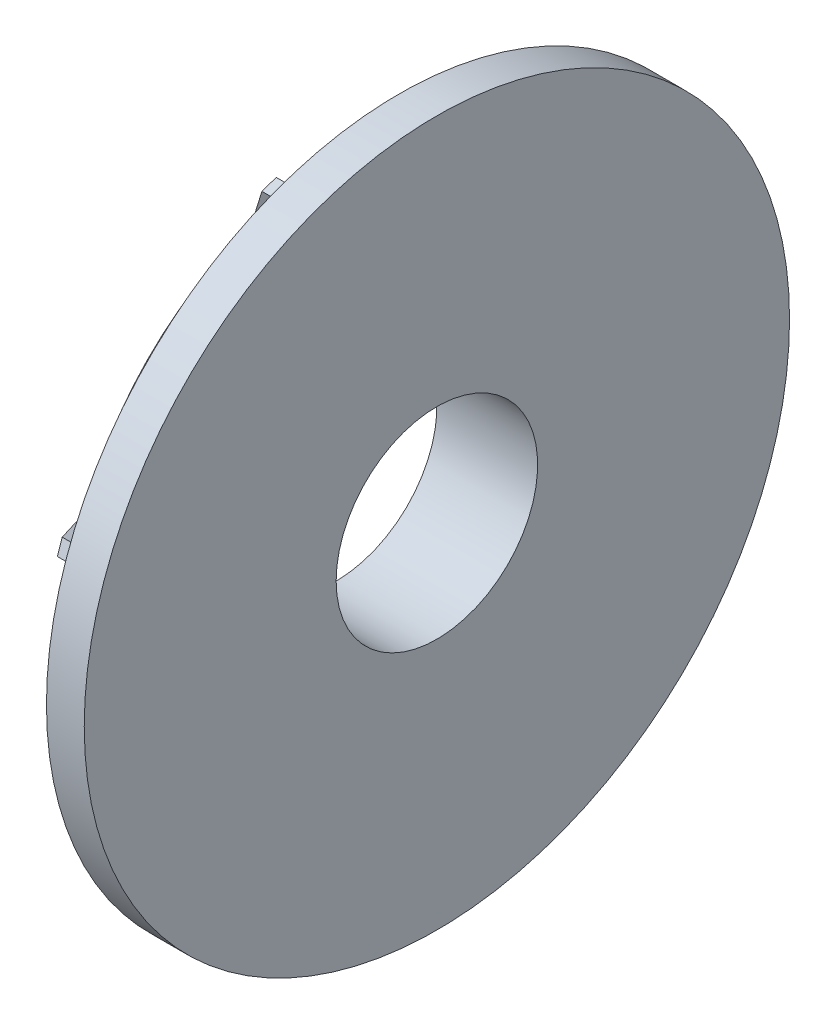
ISO-10303-21;
HEADER;
FILE_DESCRIPTION(('STEP AP214'),'2;1');
FILE_NAME('part.step','',(''),(''),'','','');
FILE_SCHEMA(('AUTOMOTIVE_DESIGN { 1 0 10303 214 1 1 1 1 }'));
ENDSEC;
DATA;
#1=APPLICATION_CONTEXT('core data for automotive mechanical design processes');
#2=APPLICATION_PROTOCOL_DEFINITION('international standard','automotive_design',2000,#1);
#3=PRODUCT_CONTEXT('',#1,'mechanical');
#4=PRODUCT('Part','Part','',(#3));
#5=PRODUCT_RELATED_PRODUCT_CATEGORY('part','',(#4));
#6=PRODUCT_DEFINITION_FORMATION('','',#4);
#7=PRODUCT_DEFINITION_CONTEXT('part definition',#1,'design');
#8=PRODUCT_DEFINITION('design','',#6,#7);
#9=PRODUCT_DEFINITION_SHAPE('','',#8);
#10=(LENGTH_UNIT() NAMED_UNIT(*) SI_UNIT(.MILLI.,.METRE.));
#11=(NAMED_UNIT(*) PLANE_ANGLE_UNIT() SI_UNIT($,.RADIAN.));
#12=(NAMED_UNIT(*) SI_UNIT($,.STERADIAN.) SOLID_ANGLE_UNIT());
#13=UNCERTAINTY_MEASURE_WITH_UNIT(LENGTH_MEASURE(1.E-05),#10,'distance_accuracy_value','');
#14=(GEOMETRIC_REPRESENTATION_CONTEXT(3) GLOBAL_UNCERTAINTY_ASSIGNED_CONTEXT((#13)) GLOBAL_UNIT_ASSIGNED_CONTEXT((#10,
#11,#12)) REPRESENTATION_CONTEXT('',''));
#15=CARTESIAN_POINT('',(0.,0.,0.));
#16=DIRECTION('',(0.,0.,1.));
#17=DIRECTION('',(1.,0.,0.));
#18=AXIS2_PLACEMENT_3D('',#15,#16,#17);
#19=CARTESIAN_POINT('',(-43.5000000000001,89.0040382,121.0040382));
#20=DIRECTION('',(-1.,0.,0.));
#21=DIRECTION('',(0.,0.,1.));
#22=AXIS2_PLACEMENT_3D('',#19,#20,#21);
#23=PLANE('',#22);
#24=CARTESIAN_POINT('',(-43.5000000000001,93.0520382,125.0520382));
#25=DIRECTION('',(-1.,0.,0.));
#26=DIRECTION('',(0.,-1.,0.));
#27=AXIS2_PLACEMENT_3D('',#24,#25,#26);
#28=CIRCLE('',#27,4.);
#29=CARTESIAN_POINT('',(-43.5000000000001,89.0520382,125.0520382));
#30=VERTEX_POINT('',#29);
#31=EDGE_CURVE('E20',#30,#30,#28,.T.);
#32=ORIENTED_EDGE('',*,*,#31,.T.);
#33=EDGE_LOOP('',(#32));
#34=FACE_BOUND('',#33,.T.);
#35=ADVANCED_FACE('F16',(#34),#23,.T.);
#36=CARTESIAN_POINT('',(-43.5,89.0040382,68.9959618));
#37=DIRECTION('',(1.,0.,0.));
#38=DIRECTION('',(0.,1.,0.));
#39=AXIS2_PLACEMENT_3D('',#36,#37,#38);
#40=PLANE('',#39);
#41=CARTESIAN_POINT('',(-43.5,93.0520382,64.9479618));
#42=DIRECTION('',(-1.,0.,0.));
#43=DIRECTION('',(0.,-1.,0.));
#44=AXIS2_PLACEMENT_3D('',#41,#42,#43);
#45=CIRCLE('',#44,4.);
#46=CARTESIAN_POINT('',(-43.5,89.0520382,64.9479618));
#47=VERTEX_POINT('',#46);
#48=EDGE_CURVE('E695',#47,#47,#45,.T.);
#49=ORIENTED_EDGE('',*,*,#48,.T.);
#50=EDGE_LOOP('',(#49));
#51=FACE_BOUND('',#50,.T.);
#52=ADVANCED_FACE('F1302',(#51),#40,.F.);
#53=CARTESIAN_POINT('',(-43.5,28.8999618,121.0040382));
#54=DIRECTION('',(-1.,0.,0.));
#55=DIRECTION('',(0.,0.,1.));
#56=AXIS2_PLACEMENT_3D('',#53,#54,#55);
#57=PLANE('',#56);
#58=CARTESIAN_POINT('',(-43.5,32.9479618,125.0520382));
#59=DIRECTION('',(-1.,0.,0.));
#60=DIRECTION('',(0.,-1.,0.));
#61=AXIS2_PLACEMENT_3D('',#58,#59,#60);
#62=CIRCLE('',#61,4.);
#63=CARTESIAN_POINT('',(-43.5,28.9479618,125.0520382));
#64=VERTEX_POINT('',#63);
#65=EDGE_CURVE('E692',#64,#64,#62,.T.);
#66=ORIENTED_EDGE('',*,*,#65,.T.);
#67=EDGE_LOOP('',(#66));
#68=FACE_BOUND('',#67,.T.);
#69=ADVANCED_FACE('F731',(#68),#57,.T.);
#70=CARTESIAN_POINT('',(-43.5,28.8999618,68.9959618));
#71=DIRECTION('',(1.,0.,0.));
#72=DIRECTION('',(0.,1.,0.));
#73=AXIS2_PLACEMENT_3D('',#70,#71,#72);
#74=PLANE('',#73);
#75=CARTESIAN_POINT('',(-43.5,32.9479618,64.9479618));
#76=DIRECTION('',(-1.,0.,0.));
#77=DIRECTION('',(0.,-1.,0.));
#78=AXIS2_PLACEMENT_3D('',#75,#76,#77);
#79=CIRCLE('',#78,4.);
#80=CARTESIAN_POINT('',(-43.5,28.9479618,64.9479618));
#81=VERTEX_POINT('',#80);
#82=EDGE_CURVE('E688',#81,#81,#79,.T.);
#83=ORIENTED_EDGE('',*,*,#82,.T.);
#84=EDGE_LOOP('',(#83));
#85=FACE_BOUND('',#84,.T.);
#86=ADVANCED_FACE('F725',(#85),#74,.F.);
#87=CARTESIAN_POINT('',(-57.5,63.,95.));
#88=DIRECTION('',(-1.,0.,0.));
#89=DIRECTION('',(0.,0.,1.));
#90=AXIS2_PLACEMENT_3D('',#87,#88,#89);
#91=CYLINDRICAL_SURFACE('',#90,35.);
#92=CARTESIAN_POINT('',(-61.,63.,95.));
#93=DIRECTION('',(-1.,0.,0.));
#94=DIRECTION('',(0.,0.,1.));
#95=AXIS2_PLACEMENT_3D('',#92,#93,#94);
#96=CIRCLE('',#95,35.);
#97=CARTESIAN_POINT('',(-61.,63.,130.));
#98=VERTEX_POINT('',#97);
#99=EDGE_CURVE('E684',#98,#98,#96,.F.);
#100=ORIENTED_EDGE('',*,*,#99,.T.);
#101=EDGE_LOOP('',(#100));
#102=FACE_BOUND('',#101,.T.);
#103=CARTESIAN_POINT('',(-57.5,63.,95.));
#104=DIRECTION('',(-1.,0.,0.));
#105=DIRECTION('',(0.,0.,1.));
#106=AXIS2_PLACEMENT_3D('',#103,#104,#105);
#107=CIRCLE('',#106,35.);
#108=CARTESIAN_POINT('',(-57.5,63.,130.));
#109=VERTEX_POINT('',#108);
#110=EDGE_CURVE('E680',#109,#109,#107,.T.);
#111=ORIENTED_EDGE('',*,*,#110,.T.);
#112=EDGE_LOOP('',(#111));
#113=FACE_BOUND('',#112,.T.);
#114=ADVANCED_FACE('F711',(#102,#113),#91,.T.);
#115=CARTESIAN_POINT('',(-43.5000000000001,93.0520382,125.0520382));
#116=DIRECTION('',(-1.,0.,0.));
#117=DIRECTION('',(0.,-1.,0.));
#118=AXIS2_PLACEMENT_3D('',#115,#116,#117);
#119=CYLINDRICAL_SURFACE('',#118,4.);
#120=ORIENTED_EDGE('',*,*,#31,.F.);
#121=EDGE_LOOP('',(#120));
#122=FACE_BOUND('',#121,.T.);
#123=CARTESIAN_POINT('',(-57.5000000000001,93.0520382,125.0520382));
#124=DIRECTION('',(-1.,0.,0.));
#125=DIRECTION('',(0.,-1.,0.));
#126=AXIS2_PLACEMENT_3D('',#123,#124,#125);
#127=CIRCLE('',#126,4.);
#128=CARTESIAN_POINT('',(-57.5000000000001,89.0520382,125.0520382));
#129=VERTEX_POINT('',#128);
#130=EDGE_CURVE('E676',#129,#129,#127,.T.);
#131=ORIENTED_EDGE('',*,*,#130,.T.);
#132=EDGE_LOOP('',(#131));
#133=FACE_BOUND('',#132,.T.);
#134=ADVANCED_FACE('F707',(#122,#133),#119,.F.);
#135=CARTESIAN_POINT('',(-43.5,93.0520382,64.9479618));
#136=DIRECTION('',(-1.,0.,0.));
#137=DIRECTION('',(0.,-1.,0.));
#138=AXIS2_PLACEMENT_3D('',#135,#136,#137);
#139=CYLINDRICAL_SURFACE('',#138,4.);
#140=ORIENTED_EDGE('',*,*,#48,.F.);
#141=EDGE_LOOP('',(#140));
#142=FACE_BOUND('',#141,.T.);
#143=CARTESIAN_POINT('',(-57.5,93.0520382,64.9479618));
#144=DIRECTION('',(-1.,0.,0.));
#145=DIRECTION('',(0.,-1.,0.));
#146=AXIS2_PLACEMENT_3D('',#143,#144,#145);
#147=CIRCLE('',#146,4.);
#148=CARTESIAN_POINT('',(-57.5,89.0520382,64.9479618));
#149=VERTEX_POINT('',#148);
#150=EDGE_CURVE('E672',#149,#149,#147,.T.);
#151=ORIENTED_EDGE('',*,*,#150,.T.);
#152=EDGE_LOOP('',(#151));
#153=FACE_BOUND('',#152,.T.);
#154=ADVANCED_FACE('F710',(#142,#153),#139,.F.);
#155=CARTESIAN_POINT('',(-43.5,32.9479618,125.0520382));
#156=DIRECTION('',(-1.,0.,0.));
#157=DIRECTION('',(0.,-1.,0.));
#158=AXIS2_PLACEMENT_3D('',#155,#156,#157);
#159=CYLINDRICAL_SURFACE('',#158,4.);
#160=ORIENTED_EDGE('',*,*,#65,.F.);
#161=EDGE_LOOP('',(#160));
#162=FACE_BOUND('',#161,.T.);
#163=CARTESIAN_POINT('',(-57.5,32.9479618,125.0520382));
#164=DIRECTION('',(-1.,0.,0.));
#165=DIRECTION('',(0.,-1.,0.));
#166=AXIS2_PLACEMENT_3D('',#163,#164,#165);
#167=CIRCLE('',#166,4.);
#168=CARTESIAN_POINT('',(-57.5,28.9479618,125.0520382));
#169=VERTEX_POINT('',#168);
#170=EDGE_CURVE('E668',#169,#169,#167,.T.);
#171=ORIENTED_EDGE('',*,*,#170,.T.);
#172=EDGE_LOOP('',(#171));
#173=FACE_BOUND('',#172,.T.);
#174=ADVANCED_FACE('F1263',(#162,#173),#159,.F.);
#175=CARTESIAN_POINT('',(-43.5,32.9479618,64.9479618));
#176=DIRECTION('',(-1.,0.,0.));
#177=DIRECTION('',(0.,-1.,0.));
#178=AXIS2_PLACEMENT_3D('',#175,#176,#177);
#179=CYLINDRICAL_SURFACE('',#178,4.);
#180=ORIENTED_EDGE('',*,*,#82,.F.);
#181=EDGE_LOOP('',(#180));
#182=FACE_BOUND('',#181,.T.);
#183=CARTESIAN_POINT('',(-57.5,32.9479618,64.9479618));
#184=DIRECTION('',(-1.,0.,0.));
#185=DIRECTION('',(0.,-1.,0.));
#186=AXIS2_PLACEMENT_3D('',#183,#184,#185);
#187=CIRCLE('',#186,4.);
#188=CARTESIAN_POINT('',(-57.5,28.9479618,64.9479618));
#189=VERTEX_POINT('',#188);
#190=EDGE_CURVE('E664',#189,#189,#187,.T.);
#191=ORIENTED_EDGE('',*,*,#190,.T.);
#192=EDGE_LOOP('',(#191));
#193=FACE_BOUND('',#192,.T.);
#194=ADVANCED_FACE('F1255',(#182,#193),#179,.F.);
#195=CARTESIAN_POINT('',(-61.0000000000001,27.58,130.42));
#196=DIRECTION('',(1.,0.,0.));
#197=DIRECTION('',(0.,1.,0.));
#198=AXIS2_PLACEMENT_3D('',#195,#196,#197);
#199=PLANE('',#198);
#200=ORIENTED_EDGE('',*,*,#99,.F.);
#201=EDGE_LOOP('',(#200));
#202=FACE_BOUND('',#201,.T.);
#203=CARTESIAN_POINT('',(-61.,63.,95.));
#204=DIRECTION('',(-1.,0.,0.));
#205=DIRECTION('',(0.,0.,1.));
#206=AXIS2_PLACEMENT_3D('',#203,#204,#205);
#207=CIRCLE('',#206,30.);
#208=CARTESIAN_POINT('',(-61.,63.,125.));
#209=VERTEX_POINT('',#208);
#210=EDGE_CURVE('E525',#209,#209,#207,.F.);
#211=ORIENTED_EDGE('',*,*,#210,.T.);
#212=EDGE_LOOP('',(#211));
#213=FACE_BOUND('',#212,.T.);
#214=ADVANCED_FACE('F978',(#202,#213),#199,.F.);
#215=CARTESIAN_POINT('',(-56.556152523,47.361293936,44.974569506));
#216=DIRECTION('',(-0.888217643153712,-0.149573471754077,-0.434392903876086));
#217=DIRECTION('',(-0.4393351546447,0.,0.898323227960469));
#218=AXIS2_PLACEMENT_3D('',#215,#216,#217);
#219=PLANE('',#218);
#220=CARTESIAN_POINT('',(-56.5110860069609,47.3329276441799,44.8921877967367));
#221=CARTESIAN_POINT('',(-56.5092385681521,47.2136100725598,44.9294944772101));
#222=CARTESIAN_POINT('',(-56.5076220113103,47.0944225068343,44.9672283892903));
#223=CARTESIAN_POINT('',(-56.5048507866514,46.8563199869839,45.0435467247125));
#224=CARTESIAN_POINT('',(-56.503696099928,46.7374050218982,45.0821311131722));
#225=CARTESIAN_POINT('',(-56.5018486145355,46.4998537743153,45.1601484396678));
#226=CARTESIAN_POINT('',(-56.5011558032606,46.3812174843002,45.1995813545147));
#227=CARTESIAN_POINT('',(-56.5002320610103,46.1442296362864,45.2792937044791));
#228=CARTESIAN_POINT('',(-56.5000011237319,46.0258780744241,45.3195731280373));
#229=CARTESIAN_POINT('',(-56.5000011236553,45.789465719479,45.4009764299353));
#230=CARTESIAN_POINT('',(-56.5002320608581,45.6714049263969,45.4421003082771));
#231=CARTESIAN_POINT('',(-56.5011558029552,45.4355801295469,45.5251904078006));
#232=CARTESIAN_POINT('',(-56.5018486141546,45.3178161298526,45.5671566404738));
#233=CARTESIAN_POINT('',(-56.5036960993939,45.0825909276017,45.651929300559));
#234=CARTESIAN_POINT('',(-56.5048507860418,44.965129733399,45.6947357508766));
#235=CARTESIAN_POINT('',(-56.5076220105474,44.7305161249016,45.7811866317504));
#236=CARTESIAN_POINT('',(-56.5092385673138,44.613363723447,45.8248310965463));
#237=CARTESIAN_POINT('',(-56.5110860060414,44.4963719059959,45.8688922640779));
#238=B_SPLINE_CURVE_WITH_KNOTS('',3,(#220,#221,#222,#223,#224,#225,#226,#227,#228,#229,#230,
#231,#232,#233,#234,#235,#236,#237),.UNSPECIFIED.,.F.,.F.,(4,2,2,2,2,2,2,2,4),(0.,
0.375081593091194,0.750147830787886,1.125203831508,1.50025471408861,1.87530559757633,
2.25036160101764,2.62542784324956,3.00050944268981),.UNSPECIFIED.);
#239=CARTESIAN_POINT('',(-56.5110860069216,47.3329276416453,44.8921877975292));
#240=VERTEX_POINT('',#239);
#241=CARTESIAN_POINT('',(-56.5110860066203,44.4963719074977,45.8688922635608));
#242=VERTEX_POINT('',#241);
#243=EDGE_CURVE('E777',#240,#242,#238,.T.);
#244=ORIENTED_EDGE('',*,*,#243,.F.);
#245=DIRECTION('',(0.459422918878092,-0.28917537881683,-0.839826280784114));
#246=VECTOR('',#245,1.);
#247=CARTESIAN_POINT('',(-56.5110860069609,47.3329276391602,44.8921877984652));
#248=LINE('',#247,#246);
#249=CARTESIAN_POINT('',(-49.0000000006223,42.6052115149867,31.1619032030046));
#250=VERTEX_POINT('',#249);
#251=EDGE_CURVE('E148',#240,#250,#248,.T.);
#252=ORIENTED_EDGE('',*,*,#251,.T.);
#253=DIRECTION('',(0.,0.945518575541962,-0.325568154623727));
#254=VECTOR('',#253,1.);
#255=CARTESIAN_POINT('',(-49.0000000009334,42.605211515,31.161903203));
#256=LINE('',#255,#254);
#257=CARTESIAN_POINT('',(-49.0000000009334,39.768655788,32.138607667));
#258=VERTEX_POINT('',#257);
#259=EDGE_CURVE('E452',#258,#250,#256,.T.);
#260=ORIENTED_EDGE('',*,*,#259,.F.);
#261=DIRECTION('',(0.45942291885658,-0.289175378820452,-0.839826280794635));
#262=VECTOR('',#261,1.);
#263=CARTESIAN_POINT('',(-56.5110860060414,44.4963719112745,45.868892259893));
#264=LINE('',#263,#262);
#265=EDGE_CURVE('E441',#242,#258,#264,.T.);
#266=ORIENTED_EDGE('',*,*,#265,.F.);
#267=EDGE_LOOP('',(#244,#252,#260,#266));
#268=FACE_BOUND('',#267,.T.);
#269=ADVANCED_FACE('F871',(#268),#219,.T.);
#270=CARTESIAN_POINT('',(-56.556152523,12.974569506,79.361293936));
#271=DIRECTION('',(0.888217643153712,0.434392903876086,0.149573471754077));
#272=DIRECTION('',(-0.4393351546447,0.898323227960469,0.));
#273=AXIS2_PLACEMENT_3D('',#270,#271,#272);
#274=PLANE('',#273);
#275=DIRECTION('',(0.,-0.325568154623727,0.945518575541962));
#276=VECTOR('',#275,1.);
#277=CARTESIAN_POINT('',(-49.0000000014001,-0.838096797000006,74.605211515));
#278=LINE('',#277,#276);
#279=CARTESIAN_POINT('',(-49.0000000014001,0.138607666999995,71.768655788));
#280=VERTEX_POINT('',#279);
#281=CARTESIAN_POINT('',(-49.000000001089,-0.838096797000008,74.605211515));
#282=VERTEX_POINT('',#281);
#283=EDGE_CURVE('E423',#280,#282,#278,.T.);
#284=ORIENTED_EDGE('',*,*,#283,.T.);
#285=DIRECTION('',(-0.45942291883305,0.839826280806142,0.289175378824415));
#286=VECTOR('',#285,1.);
#287=CARTESIAN_POINT('',(-49.0000000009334,-0.838096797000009,74.605211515));
#288=LINE('',#287,#286);
#289=CARTESIAN_POINT('',(-56.5110860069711,12.8921877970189,79.3329276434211));
#290=VERTEX_POINT('',#289);
#291=EDGE_CURVE('E422',#282,#290,#288,.T.);
#292=ORIENTED_EDGE('',*,*,#291,.T.);
#293=CARTESIAN_POINT('',(-56.5110860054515,13.8688922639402,76.4963719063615));
#294=CARTESIAN_POINT('',(-56.5092385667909,13.8248310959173,76.6133637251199));
#295=CARTESIAN_POINT('',(-56.507622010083,13.7811866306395,76.7305161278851));
#296=CARTESIAN_POINT('',(-56.504850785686,13.6947357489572,76.9651297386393));
#297=CARTESIAN_POINT('',(-56.5036960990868,13.6519292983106,77.0825909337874));
#298=CARTESIAN_POINT('',(-56.5018486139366,13.5671566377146,77.317816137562));
#299=CARTESIAN_POINT('',(-56.5011558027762,13.5251904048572,77.4355801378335));
#300=CARTESIAN_POINT('',(-56.5002320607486,13.4421003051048,77.6714049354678));
#301=CARTESIAN_POINT('',(-56.5000011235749,13.4009764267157,77.789465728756));
#302=CARTESIAN_POINT('',(-56.5000011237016,13.3195731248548,78.0258780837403));
#303=CARTESIAN_POINT('',(-56.5002320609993,13.2792937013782,78.1442296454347));
#304=CARTESIAN_POINT('',(-56.5011558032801,13.1995813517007,78.3812174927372));
#305=CARTESIAN_POINT('',(-56.5018486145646,13.1601484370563,78.4998537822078));
#306=CARTESIAN_POINT('',(-56.503696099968,13.0821311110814,78.7374050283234));
#307=CARTESIAN_POINT('',(-56.5048507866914,13.0435467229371,78.8563199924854));
#308=CARTESIAN_POINT('',(-56.5076220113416,12.9672283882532,79.0944225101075));
#309=CARTESIAN_POINT('',(-56.5092385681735,12.9294944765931,79.2136100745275));
#310=CARTESIAN_POINT('',(-56.5110860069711,12.8921877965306,79.3329276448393));
#311=B_SPLINE_CURVE_WITH_KNOTS('',3,(#293,#294,#295,#296,#297,#298,#299,#300,#301,#302,#303,
#304,#305,#306,#307,#308,#309,#310),.UNSPECIFIED.,.F.,.F.,(4,2,2,2,2,2,2,2,4),(0.,
0.375081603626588,0.750147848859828,1.12520385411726,1.50025473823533,1.87530562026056,
2.25036161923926,2.62542785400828,3.0005094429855),.UNSPECIFIED.);
#312=CARTESIAN_POINT('',(-56.5110860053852,13.868892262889,76.4963719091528));
#313=VERTEX_POINT('',#312);
#314=EDGE_CURVE('E781',#313,#290,#311,.T.);
#315=ORIENTED_EDGE('',*,*,#314,.F.);
#316=DIRECTION('',(-0.459422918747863,0.839826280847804,0.28917537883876));
#317=VECTOR('',#316,1.);
#318=CARTESIAN_POINT('',(-49.0000000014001,0.138607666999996,71.768655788));
#319=LINE('',#318,#317);
#320=EDGE_CURVE('E435',#280,#313,#319,.T.);
#321=ORIENTED_EDGE('',*,*,#320,.F.);
#322=EDGE_LOOP('',(#284,#292,#315,#321));
#323=FACE_BOUND('',#322,.T.);
#324=ADVANCED_FACE('F966',(#323),#274,.F.);
#325=CARTESIAN_POINT('',(-56.556152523,12.974569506,110.638706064));
#326=DIRECTION('',(-0.888217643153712,-0.434392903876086,0.149573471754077));
#327=DIRECTION('',(0.4393351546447,-0.898323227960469,0.));
#328=AXIS2_PLACEMENT_3D('',#325,#326,#327);
#329=PLANE('',#328);
#330=CARTESIAN_POINT('',(-56.5110860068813,12.8921877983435,110.667072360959));
#331=CARTESIAN_POINT('',(-56.5092385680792,12.9294944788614,110.786389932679));
#332=CARTESIAN_POINT('',(-56.5076220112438,12.967228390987,110.905577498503));
#333=CARTESIAN_POINT('',(-56.5048507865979,13.0435467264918,111.143680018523));
#334=CARTESIAN_POINT('',(-56.5036960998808,13.0821311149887,111.262594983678));
#335=CARTESIAN_POINT('',(-56.5018486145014,13.1601484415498,111.50014623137));
#336=CARTESIAN_POINT('',(-56.501155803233,13.199581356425,111.618782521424));
#337=CARTESIAN_POINT('',(-56.5002320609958,13.2792937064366,111.855770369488));
#338=CARTESIAN_POINT('',(-56.500001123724,13.3195731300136,111.97412193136));
#339=CARTESIAN_POINT('',(-56.5000011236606,13.4009764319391,112.210534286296));
#340=CARTESIAN_POINT('',(-56.5002320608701,13.4421003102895,112.328595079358));
#341=CARTESIAN_POINT('',(-56.5011558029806,13.5251904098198,112.56441987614));
#342=CARTESIAN_POINT('',(-56.5018486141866,13.5671566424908,112.682183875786));
#343=CARTESIAN_POINT('',(-56.5036960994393,13.6519293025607,112.917409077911));
#344=CARTESIAN_POINT('',(-56.504850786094,13.6947357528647,113.034870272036));
#345=CARTESIAN_POINT('',(-56.5076220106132,13.7811866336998,113.269483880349));
#346=CARTESIAN_POINT('',(-56.5092385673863,13.8248310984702,113.386636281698));
#347=CARTESIAN_POINT('',(-56.511086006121,13.8688922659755,113.503628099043));
#348=B_SPLINE_CURVE_WITH_KNOTS('',3,(#330,#331,#332,#333,#334,#335,#336,#337,#338,#339,#340,
#341,#342,#343,#344,#345,#346,#347),.UNSPECIFIED.,.F.,.F.,(4,2,2,2,2,2,2,2,4),(0.,
0.375081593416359,0.750147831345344,1.12520383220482,1.50025471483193,1.87530559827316,
2.25036160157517,2.62542784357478,3.00050944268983),.UNSPECIFIED.);
#349=CARTESIAN_POINT('',(-56.5110860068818,12.8921877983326,110.667072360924));
#350=VERTEX_POINT('',#349);
#351=CARTESIAN_POINT('',(-56.5110860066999,13.8688922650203,113.503628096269));
#352=VERTEX_POINT('',#351);
#353=EDGE_CURVE('E785',#350,#352,#348,.T.);
#354=ORIENTED_EDGE('',*,*,#353,.F.);
#355=DIRECTION('',(0.459422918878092,-0.839826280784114,0.28917537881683));
#356=VECTOR('',#355,1.);
#357=CARTESIAN_POINT('',(-56.5110860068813,12.8921877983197,110.66707236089));
#358=LINE('',#357,#356);
#359=CARTESIAN_POINT('',(-49.0000000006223,-0.838096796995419,115.394788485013));
#360=VERTEX_POINT('',#359);
#361=EDGE_CURVE('E575',#350,#360,#358,.T.);
#362=ORIENTED_EDGE('',*,*,#361,.T.);
#363=DIRECTION('',(0.,-0.325568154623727,-0.945518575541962));
#364=VECTOR('',#363,1.);
#365=CARTESIAN_POINT('',(-49.0000000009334,-0.838096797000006,115.394788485));
#366=LINE('',#365,#364);
#367=CARTESIAN_POINT('',(-49.0000000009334,0.138607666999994,118.231344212));
#368=VERTEX_POINT('',#367);
#369=EDGE_CURVE('E415',#368,#360,#366,.T.);
#370=ORIENTED_EDGE('',*,*,#369,.F.);
#371=DIRECTION('',(0.45942291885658,-0.839826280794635,0.289175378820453));
#372=VECTOR('',#371,1.);
#373=CARTESIAN_POINT('',(-56.511086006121,13.8688922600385,113.503628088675));
#374=LINE('',#373,#372);
#375=EDGE_CURVE('E405',#352,#368,#374,.T.);
#376=ORIENTED_EDGE('',*,*,#375,.F.);
#377=EDGE_LOOP('',(#354,#362,#370,#376));
#378=FACE_BOUND('',#377,.T.);
#379=ADVANCED_FACE('F970',(#378),#329,.T.);
#380=CARTESIAN_POINT('',(-56.5561525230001,47.361293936,145.025430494));
#381=DIRECTION('',(0.888217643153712,0.149573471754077,-0.434392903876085));
#382=DIRECTION('',(-0.4393351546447,0.,-0.89832322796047));
#383=AXIS2_PLACEMENT_3D('',#380,#381,#382);
#384=PLANE('',#383);
#385=DIRECTION('',(0.,0.945518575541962,0.325568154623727));
#386=VECTOR('',#385,1.);
#387=CARTESIAN_POINT('',(-49.0000000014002,42.605211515,158.838096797));
#388=LINE('',#387,#386);
#389=CARTESIAN_POINT('',(-49.0000000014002,39.768655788,157.861392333));
#390=VERTEX_POINT('',#389);
#391=CARTESIAN_POINT('',(-49.000000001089,42.605211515,158.838096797));
#392=VERTEX_POINT('',#391);
#393=EDGE_CURVE('E158',#390,#392,#388,.T.);
#394=ORIENTED_EDGE('',*,*,#393,.T.);
#395=DIRECTION('',(-0.459422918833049,0.289175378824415,-0.839826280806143));
#396=VECTOR('',#395,1.);
#397=CARTESIAN_POINT('',(-49.0000000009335,42.605211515,158.838096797));
#398=LINE('',#397,#396);
#399=CARTESIAN_POINT('',(-56.5110860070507,47.3329276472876,145.10781220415));
#400=VERTEX_POINT('',#399);
#401=EDGE_CURVE('E387',#392,#400,#398,.T.);
#402=ORIENTED_EDGE('',*,*,#401,.T.);
#403=CARTESIAN_POINT('',(-56.511086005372,44.4963719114,144.131107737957));
#404=CARTESIAN_POINT('',(-56.5092385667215,44.6133637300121,144.175168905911));
#405=CARTESIAN_POINT('',(-56.5076220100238,44.7305161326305,144.218813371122));
#406=CARTESIAN_POINT('',(-56.5048507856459,44.9651297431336,144.305264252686));
#407=CARTESIAN_POINT('',(-56.5036960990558,45.0825909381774,144.348070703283));
#408=CARTESIAN_POINT('',(-56.5018486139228,45.317816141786,144.432843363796));
#409=CARTESIAN_POINT('',(-56.5011558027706,45.435580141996,144.47480959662));
#410=CARTESIAN_POINT('',(-56.5002320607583,45.6714049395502,144.557899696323));
#411=CARTESIAN_POINT('',(-56.5000011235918,45.7894657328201,144.599023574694));
#412=CARTESIAN_POINT('',(-56.5000011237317,46.025878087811,144.680426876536));
#413=CARTESIAN_POINT('',(-56.5002320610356,46.1442296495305,144.72070630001));
#414=CARTESIAN_POINT('',(-56.5011558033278,46.3812174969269,144.800418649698));
#415=CARTESIAN_POINT('',(-56.5018486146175,46.4998537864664,144.839851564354));
#416=CARTESIAN_POINT('',(-56.5036961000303,46.7374050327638,144.917868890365));
#417=CARTESIAN_POINT('',(-56.5048507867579,46.8563199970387,144.956453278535));
#418=CARTESIAN_POINT('',(-56.5076220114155,47.0944225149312,145.032771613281));
#419=CARTESIAN_POINT('',(-56.5092385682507,47.2136100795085,145.070505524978));
#420=CARTESIAN_POINT('',(-56.5110860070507,47.332927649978,145.107812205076));
#421=B_SPLINE_CURVE_WITH_KNOTS('',3,(#403,#404,#405,#406,#407,#408,#409,#410,#411,#412,#413,
#414,#415,#416,#417,#418,#419,#420),.UNSPECIFIED.,.F.,.F.,(4,2,2,2,2,2,2,2,4),(0.,
0.375081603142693,0.750147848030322,1.12520385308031,1.50025473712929,1.8753056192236,
2.2503616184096,2.62542785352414,3.00050944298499),.UNSPECIFIED.);
#422=CARTESIAN_POINT('',(-56.5110860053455,44.4963719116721,144.13110773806));
#423=VERTEX_POINT('',#422);
#424=EDGE_CURVE('E789',#423,#400,#421,.T.);
#425=ORIENTED_EDGE('',*,*,#424,.F.);
#426=DIRECTION('',(-0.459422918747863,0.28917537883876,-0.839826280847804));
#427=VECTOR('',#426,1.);
#428=CARTESIAN_POINT('',(-49.0000000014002,39.768655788,157.861392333));
#429=LINE('',#428,#427);
#430=EDGE_CURVE('E399',#390,#423,#429,.T.);
#431=ORIENTED_EDGE('',*,*,#430,.F.);
#432=EDGE_LOOP('',(#394,#402,#425,#431));
#433=FACE_BOUND('',#432,.T.);
#434=ADVANCED_FACE('F975',(#433),#384,.F.);
#435=CARTESIAN_POINT('',(-56.5561525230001,113.025430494,110.638706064));
#436=DIRECTION('',(0.888217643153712,-0.434392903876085,-0.149573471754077));
#437=DIRECTION('',(0.4393351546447,0.898323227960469,0.));
#438=AXIS2_PLACEMENT_3D('',#435,#436,#437);
#439=PLANE('',#438);
#440=DIRECTION('',(0.,0.325568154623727,-0.945518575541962));
#441=VECTOR('',#440,1.);
#442=CARTESIAN_POINT('',(-49.0000000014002,126.838096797,115.394788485));
#443=LINE('',#442,#441);
#444=CARTESIAN_POINT('',(-49.0000000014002,125.861392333,118.231344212));
#445=VERTEX_POINT('',#444);
#446=CARTESIAN_POINT('',(-49.000000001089,126.838096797,115.394788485));
#447=VERTEX_POINT('',#446);
#448=EDGE_CURVE('E497',#445,#447,#443,.T.);
#449=ORIENTED_EDGE('',*,*,#448,.T.);
#450=DIRECTION('',(-0.459422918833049,-0.839826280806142,-0.289175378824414));
#451=VECTOR('',#450,1.);
#452=CARTESIAN_POINT('',(-49.0000000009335,126.838096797,115.394788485));
#453=LINE('',#452,#451);
#454=CARTESIAN_POINT('',(-56.511086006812,113.107812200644,110.667072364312));
#455=VERTEX_POINT('',#454);
#456=EDGE_CURVE('E496',#447,#455,#453,.T.);
#457=ORIENTED_EDGE('',*,*,#456,.T.);
#458=CARTESIAN_POINT('',(-56.5110860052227,112.131107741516,113.50362807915));
#459=CARTESIAN_POINT('',(-56.5092385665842,112.175168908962,113.386636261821));
#460=CARTESIAN_POINT('',(-56.5076220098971,112.218813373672,113.26948386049));
#461=CARTESIAN_POINT('',(-56.5048507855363,112.305264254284,113.034870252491));
#462=CARTESIAN_POINT('',(-56.5036960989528,112.348070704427,112.917409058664));
#463=CARTESIAN_POINT('',(-56.5018486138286,112.432843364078,112.682183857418));
#464=CARTESIAN_POINT('',(-56.5011558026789,112.474809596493,112.564419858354));
#465=CARTESIAN_POINT('',(-56.5002320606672,112.557899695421,112.32859506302));
#466=CARTESIAN_POINT('',(-56.5000011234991,112.599023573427,112.210534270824));
#467=CARTESIAN_POINT('',(-56.5000011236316,112.680426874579,111.974121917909));
#468=CARTESIAN_POINT('',(-56.5002320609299,112.720706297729,111.855770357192));
#469=CARTESIAN_POINT('',(-56.5011558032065,112.800418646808,111.618782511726));
#470=CARTESIAN_POINT('',(-56.5018486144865,112.839851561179,111.500146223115));
#471=CARTESIAN_POINT('',(-56.5036960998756,112.917868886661,111.262594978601));
#472=CARTESIAN_POINT('',(-56.5048507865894,112.956453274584,111.14368001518));
#473=CARTESIAN_POINT('',(-56.5076220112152,113.032771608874,110.905577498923));
#474=CARTESIAN_POINT('',(-56.5092385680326,113.070505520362,110.786389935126));
#475=CARTESIAN_POINT('',(-56.511086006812,113.107812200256,110.667072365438));
#476=B_SPLINE_CURVE_WITH_KNOTS('',3,(#458,#459,#460,#461,#462,#463,#464,#465,#466,#467,#468,
#469,#470,#471,#472,#473,#474,#475),.UNSPECIFIED.,.F.,.F.,(4,2,2,2,2,2,2,2,4),(0.,
0.375081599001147,0.750147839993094,1.12520384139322,1.50025472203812,1.87530560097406,
2.25036159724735,2.62542782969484,3.00050941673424),.UNSPECIFIED.);
#477=CARTESIAN_POINT('',(-56.5110860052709,112.131107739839,113.503628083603));
#478=VERTEX_POINT('',#477);
#479=EDGE_CURVE('E797',#478,#455,#476,.T.);
#480=ORIENTED_EDGE('',*,*,#479,.F.);
#481=DIRECTION('',(-0.459422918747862,-0.839826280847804,-0.28917537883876));
#482=VECTOR('',#481,1.);
#483=CARTESIAN_POINT('',(-49.0000000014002,125.861392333,118.231344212));
#484=LINE('',#483,#482);
#485=EDGE_CURVE('E509',#445,#478,#484,.T.);
#486=ORIENTED_EDGE('',*,*,#485,.F.);
#487=EDGE_LOOP('',(#449,#457,#480,#486));
#488=FACE_BOUND('',#487,.T.);
#489=ADVANCED_FACE('F984',(#488),#439,.F.);
#490=CARTESIAN_POINT('',(-56.556152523,113.025430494,79.361293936));
#491=DIRECTION('',(-0.888217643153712,0.434392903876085,-0.149573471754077));
#492=DIRECTION('',(-0.4393351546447,-0.898323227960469,0.));
#493=AXIS2_PLACEMENT_3D('',#490,#491,#492);
#494=PLANE('',#493);
#495=CARTESIAN_POINT('',(-56.5110860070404,113.10781220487,79.3329276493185));
#496=CARTESIAN_POINT('',(-56.5092385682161,113.070505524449,79.2136100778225));
#497=CARTESIAN_POINT('',(-56.5076220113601,113.032771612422,79.0944225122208));
#498=CARTESIAN_POINT('',(-56.504850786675,112.956453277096,78.8563199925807));
#499=CARTESIAN_POINT('',(-56.5036960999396,112.917868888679,78.7374050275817));
#500=CARTESIAN_POINT('',(-56.5018486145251,112.839851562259,78.4998537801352));
#501=CARTESIAN_POINT('',(-56.5011558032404,112.800418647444,78.38121749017));
#502=CARTESIAN_POINT('',(-56.5002320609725,112.720706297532,78.1442296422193));
#503=CARTESIAN_POINT('',(-56.5000011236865,112.680426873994,78.0258780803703));
#504=CARTESIAN_POINT('',(-56.5000011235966,112.599023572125,77.7894657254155));
#505=CARTESIAN_POINT('',(-56.500232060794,112.557899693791,77.6714049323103));
#506=CARTESIAN_POINT('',(-56.5011558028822,112.47480959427,77.4355801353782));
#507=CARTESIAN_POINT('',(-56.5018486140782,112.432843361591,77.3178161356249));
#508=CARTESIAN_POINT('',(-56.5036960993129,112.348070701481,77.0825909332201));
#509=CARTESIAN_POINT('',(-56.5048507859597,112.305264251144,76.9651297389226));
#510=CARTESIAN_POINT('',(-56.5076220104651,112.218813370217,76.7305161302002));
#511=CARTESIAN_POINT('',(-56.5092385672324,112.175168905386,76.6133637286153));
#512=CARTESIAN_POINT('',(-56.5110860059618,112.13110773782,76.4963719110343));
#513=B_SPLINE_CURVE_WITH_KNOTS('',3,(#495,#496,#497,#498,#499,#500,#501,#502,#503,#504,#505,
#506,#507,#508,#509,#510,#511,#512),.UNSPECIFIED.,.F.,.F.,(4,2,2,2,2,2,2,2,4),(0.,
0.375081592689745,0.750147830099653,1.12520383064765,1.50025471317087,1.87530559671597,
2.25036160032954,2.62542784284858,3.00050944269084),.UNSPECIFIED.);
#514=CARTESIAN_POINT('',(-56.5110860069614,113.107812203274,79.3329276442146));
#515=VERTEX_POINT('',#514);
#516=CARTESIAN_POINT('',(-56.5110860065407,112.131107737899,76.496371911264));
#517=VERTEX_POINT('',#516);
#518=EDGE_CURVE('E802',#515,#517,#513,.T.);
#519=ORIENTED_EDGE('',*,*,#518,.F.);
#520=DIRECTION('',(0.459422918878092,0.839826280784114,-0.289175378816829));
#521=VECTOR('',#520,1.);
#522=CARTESIAN_POINT('',(-56.5110860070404,113.107812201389,79.3329276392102));
#523=LINE('',#522,#521);
#524=CARTESIAN_POINT('',(-49.0000000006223,126.838096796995,74.6052115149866));
#525=VERTEX_POINT('',#524);
#526=EDGE_CURVE('E541',#515,#525,#523,.T.);
#527=ORIENTED_EDGE('',*,*,#526,.T.);
#528=DIRECTION('',(0.,0.325568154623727,0.945518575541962));
#529=VECTOR('',#528,1.);
#530=CARTESIAN_POINT('',(-49.0000000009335,126.838096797,74.605211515));
#531=LINE('',#530,#529);
#532=CARTESIAN_POINT('',(-49.0000000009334,125.861392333,71.768655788));
#533=VERTEX_POINT('',#532);
#534=EDGE_CURVE('E489',#533,#525,#531,.T.);
#535=ORIENTED_EDGE('',*,*,#534,.F.);
#536=DIRECTION('',(0.459422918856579,0.839826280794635,-0.289175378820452));
#537=VECTOR('',#536,1.);
#538=CARTESIAN_POINT('',(-56.5110860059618,112.131107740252,76.4963719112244));
#539=LINE('',#538,#537);
#540=EDGE_CURVE('E478',#517,#533,#539,.T.);
#541=ORIENTED_EDGE('',*,*,#540,.F.);
#542=EDGE_LOOP('',(#519,#527,#535,#541));
#543=FACE_BOUND('',#542,.T.);
#544=ADVANCED_FACE('F987',(#543),#494,.T.);
#545=CARTESIAN_POINT('',(-56.556152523,78.638706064,44.974569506));
#546=DIRECTION('',(0.888217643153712,-0.149573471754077,0.434392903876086));
#547=DIRECTION('',(0.4393351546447,0.,-0.898323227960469));
#548=AXIS2_PLACEMENT_3D('',#545,#546,#547);
#549=PLANE('',#548);
#550=DIRECTION('',(0.,-0.945518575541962,-0.325568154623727));
#551=VECTOR('',#550,1.);
#552=CARTESIAN_POINT('',(-49.0000000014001,83.394788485,31.161903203));
#553=LINE('',#552,#551);
#554=CARTESIAN_POINT('',(-49.0000000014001,86.231344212,32.138607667));
#555=VERTEX_POINT('',#554);
#556=CARTESIAN_POINT('',(-49.000000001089,83.394788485,31.161903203));
#557=VERTEX_POINT('',#556);
#558=EDGE_CURVE('E460',#555,#557,#553,.T.);
#559=ORIENTED_EDGE('',*,*,#558,.T.);
#560=DIRECTION('',(-0.45942291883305,-0.289175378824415,0.839826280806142));
#561=VECTOR('',#560,1.);
#562=CARTESIAN_POINT('',(-49.0000000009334,83.394788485,31.161903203));
#563=LINE('',#562,#561);
#564=CARTESIAN_POINT('',(-56.5110860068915,78.6670723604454,44.8921877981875));
#565=VERTEX_POINT('',#564);
#566=EDGE_CURVE('E459',#557,#565,#563,.T.);
#567=ORIENTED_EDGE('',*,*,#566,.T.);
#568=CARTESIAN_POINT('',(-56.5110860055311,81.5036280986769,45.8688922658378));
#569=CARTESIAN_POINT('',(-56.5092385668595,81.3866362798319,45.8248310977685));
#570=CARTESIAN_POINT('',(-56.5076220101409,81.2694838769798,45.781186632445));
#571=CARTESIAN_POINT('',(-56.5048507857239,81.0348702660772,45.6947357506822));
#572=CARTESIAN_POINT('',(-56.5036960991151,80.9174090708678,45.6519293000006));
#573=CARTESIAN_POINT('',(-56.5018486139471,80.6821838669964,45.567156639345));
#574=CARTESIAN_POINT('',(-56.5011558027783,80.5644198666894,45.5251904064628));
#575=CARTESIAN_POINT('',(-56.5002320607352,80.3285950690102,45.4421003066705));
#576=CARTESIAN_POINT('',(-56.5000011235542,80.2105342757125,45.4009764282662));
#577=CARTESIAN_POINT('',(-56.5000011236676,79.9741219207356,45.319573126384));
#578=CARTESIAN_POINT('',(-56.5002320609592,79.8557703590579,45.2792937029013));
#579=CARTESIAN_POINT('',(-56.5011558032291,79.6187825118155,45.19958135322));
#580=CARTESIAN_POINT('',(-56.5018486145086,79.5001462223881,45.1601484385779));
#581=CARTESIAN_POINT('',(-56.5036960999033,79.2625949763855,45.0821311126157));
#582=CARTESIAN_POINT('',(-56.5048507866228,79.1436800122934,45.0435467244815));
#583=CARTESIAN_POINT('',(-56.5076220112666,78.9055774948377,44.9672283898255));
#584=CARTESIAN_POINT('',(-56.5092385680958,78.7863899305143,44.9294944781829));
#585=CARTESIAN_POINT('',(-56.5110860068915,78.6670723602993,44.8921877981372));
#586=B_SPLINE_CURVE_WITH_KNOTS('',3,(#568,#569,#570,#571,#572,#573,#574,#575,#576,#577,#578,
#579,#580,#581,#582,#583,#584,#585),.UNSPECIFIED.,.F.,.F.,(4,2,2,2,2,2,2,2,4),(0.,
0.3750816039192,0.750147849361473,1.12520385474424,1.50025473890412,1.87530562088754,
2.25036161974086,2.62542785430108,3.00050944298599),.UNSPECIFIED.);
#587=CARTESIAN_POINT('',(-56.511086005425,81.5036280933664,45.8688922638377));
#588=VERTEX_POINT('',#587);
#589=EDGE_CURVE('E770',#588,#565,#586,.T.);
#590=ORIENTED_EDGE('',*,*,#589,.F.);
#591=DIRECTION('',(-0.459422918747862,-0.28917537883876,0.839826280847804));
#592=VECTOR('',#591,1.);
#593=CARTESIAN_POINT('',(-49.0000000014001,86.231344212,32.138607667));
#594=LINE('',#593,#592);
#595=EDGE_CURVE('E472',#555,#588,#594,.T.);
#596=ORIENTED_EDGE('',*,*,#595,.F.);
#597=EDGE_LOOP('',(#559,#567,#590,#596));
#598=FACE_BOUND('',#597,.T.);
#599=ADVANCED_FACE('F719',(#598),#549,.F.);
#600=CARTESIAN_POINT('',(-57.5,9.87000000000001,148.13));
#601=DIRECTION('',(1.,0.,0.));
#602=DIRECTION('',(0.,1.,0.));
#603=AXIS2_PLACEMENT_3D('',#600,#601,#602);
#604=PLANE('',#603);
#605=CARTESIAN_POINT('',(-57.5,63.,95.));
#606=DIRECTION('',(-1.,0.,0.));
#607=DIRECTION('',(0.,0.,1.));
#608=AXIS2_PLACEMENT_3D('',#605,#606,#607);
#609=CIRCLE('',#608,52.5);
#610=CARTESIAN_POINT('',(-57.5000000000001,63.,147.5));
#611=VERTEX_POINT('',#610);
#612=EDGE_CURVE('E520',#611,#611,#609,.F.);
#613=ORIENTED_EDGE('',*,*,#612,.F.);
#614=EDGE_LOOP('',(#613));
#615=FACE_BOUND('',#614,.T.);
#616=ORIENTED_EDGE('',*,*,#190,.F.);
#617=EDGE_LOOP('',(#616));
#618=FACE_BOUND('',#617,.T.);
#619=ORIENTED_EDGE('',*,*,#170,.F.);
#620=EDGE_LOOP('',(#619));
#621=FACE_BOUND('',#620,.T.);
#622=ORIENTED_EDGE('',*,*,#150,.F.);
#623=EDGE_LOOP('',(#622));
#624=FACE_BOUND('',#623,.T.);
#625=ORIENTED_EDGE('',*,*,#130,.F.);
#626=EDGE_LOOP('',(#625));
#627=FACE_BOUND('',#626,.T.);
#628=ORIENTED_EDGE('',*,*,#110,.F.);
#629=EDGE_LOOP('',(#628));
#630=FACE_BOUND('',#629,.T.);
#631=ADVANCED_FACE('F715',(#615,#618,#621,#624,#627,#630),#604,.F.);
#632=CARTESIAN_POINT('',(-56.5561525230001,78.638706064,145.025430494));
#633=DIRECTION('',(-0.888217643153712,0.149573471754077,0.434392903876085));
#634=DIRECTION('',(0.4393351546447,0.,0.898323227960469));
#635=AXIS2_PLACEMENT_3D('',#632,#633,#634);
#636=PLANE('',#635);
#637=CARTESIAN_POINT('',(-56.5110860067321,78.6670723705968,145.107812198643));
#638=CARTESIAN_POINT('',(-56.509238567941,78.7863899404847,145.070505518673));
#639=CARTESIAN_POINT('',(-56.5076220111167,78.9055775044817,145.032771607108));
#640=CARTESIAN_POINT('',(-56.504850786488,79.1436800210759,144.956453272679));
#641=CARTESIAN_POINT('',(-56.5036960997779,79.2625949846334,144.917868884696));
#642=CARTESIAN_POINT('',(-56.5018486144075,79.5001462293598,144.839851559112));
#643=CARTESIAN_POINT('',(-56.501155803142,79.6187825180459,144.800418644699));
#644=CARTESIAN_POINT('',(-56.5002320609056,79.8557703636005,144.720706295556));
#645=CARTESIAN_POINT('',(-56.5000011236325,79.9741219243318,144.680426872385));
#646=CARTESIAN_POINT('',(-56.5000011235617,80.2105342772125,144.59902357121));
#647=CARTESIAN_POINT('',(-56.5002320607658,80.3285950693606,144.557899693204));
#648=CARTESIAN_POINT('',(-56.5011558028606,80.5644198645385,144.474809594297));
#649=CARTESIAN_POINT('',(-56.5018486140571,80.6821838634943,144.432843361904));
#650=CARTESIAN_POINT('',(-56.503696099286,80.9174090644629,144.348070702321));
#651=CARTESIAN_POINT('',(-56.5048507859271,81.0348702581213,144.305264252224));
#652=CARTESIAN_POINT('',(-56.5076220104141,81.2694838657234,144.218813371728));
#653=CARTESIAN_POINT('',(-56.5092385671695,81.3866362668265,144.175168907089));
#654=CARTESIAN_POINT('',(-56.5110860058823,81.5036280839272,144.131107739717));
#655=B_SPLINE_CURVE_WITH_KNOTS('',3,(#637,#638,#639,#640,#641,#642,#643,#644,#645,#646,#647,
#648,#649,#650,#651,#652,#653,#654),.UNSPECIFIED.,.F.,.F.,(4,2,2,2,2,2,2,2,4),(0.,
0.375081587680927,0.750147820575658,1.12520381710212,1.50025469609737,1.87530557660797,
2.2503615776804,2.62542781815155,3.00050941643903),.UNSPECIFIED.);
#656=CARTESIAN_POINT('',(-56.5110860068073,78.667072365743,145.107812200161));
#657=VERTEX_POINT('',#656);
#658=CARTESIAN_POINT('',(-56.5110860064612,81.5036280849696,144.131107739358));
#659=VERTEX_POINT('',#658);
#660=EDGE_CURVE('E793',#657,#659,#655,.T.);
#661=ORIENTED_EDGE('',*,*,#660,.F.);
#662=DIRECTION('',(0.459422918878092,0.289175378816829,0.839826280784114));
#663=VECTOR('',#662,1.);
#664=CARTESIAN_POINT('',(-56.5110860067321,78.6670723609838,145.107812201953));
#665=LINE('',#664,#663);
#666=CARTESIAN_POINT('',(-49.0000000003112,83.394788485,158.838096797));
#667=VERTEX_POINT('',#666);
#668=EDGE_CURVE('E253',#657,#667,#665,.T.);
#669=ORIENTED_EDGE('',*,*,#668,.T.);
#670=DIRECTION('',(0.,-0.945518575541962,0.325568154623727));
#671=VECTOR('',#670,1.);
#672=CARTESIAN_POINT('',(-49.0000000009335,83.394788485,158.838096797));
#673=LINE('',#672,#671);
#674=CARTESIAN_POINT('',(-49.0000000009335,86.231344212,157.861392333));
#675=VERTEX_POINT('',#674);
#676=EDGE_CURVE('E233',#675,#667,#673,.T.);
#677=ORIENTED_EDGE('',*,*,#676,.F.);
#678=DIRECTION('',(0.459422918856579,0.289175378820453,0.839826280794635));
#679=VECTOR('',#678,1.);
#680=CARTESIAN_POINT('',(-56.5110860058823,81.5036280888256,144.131107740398));
#681=LINE('',#680,#679);
#682=EDGE_CURVE('E515',#659,#675,#681,.T.);
#683=ORIENTED_EDGE('',*,*,#682,.F.);
#684=EDGE_LOOP('',(#661,#669,#677,#683));
#685=FACE_BOUND('',#684,.T.);
#686=ADVANCED_FACE('F718',(#685),#636,.T.);
#687=CARTESIAN_POINT('',(-57.5,63.,95.));
#688=DIRECTION('',(-1.,0.,0.));
#689=DIRECTION('',(0.,0.,1.));
#690=AXIS2_PLACEMENT_3D('',#687,#688,#689);
#691=CYLINDRICAL_SURFACE('',#690,30.);
#692=ORIENTED_EDGE('',*,*,#210,.F.);
#693=EDGE_LOOP('',(#692));
#694=FACE_BOUND('',#693,.T.);
#695=CARTESIAN_POINT('',(-57.5,63.,95.));
#696=DIRECTION('',(-1.,0.,0.));
#697=DIRECTION('',(0.,0.,1.));
#698=AXIS2_PLACEMENT_3D('',#695,#696,#697);
#699=CIRCLE('',#698,30.);
#700=CARTESIAN_POINT('',(-57.5,63.,125.));
#701=VERTEX_POINT('',#700);
#702=EDGE_CURVE('E247',#701,#701,#699,.F.);
#703=ORIENTED_EDGE('',*,*,#702,.T.);
#704=EDGE_LOOP('',(#703));
#705=FACE_BOUND('',#704,.T.);
#706=ADVANCED_FACE('F997',(#694,#705),#691,.F.);
#707=CARTESIAN_POINT('',(-49.0000000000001,83.394788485,158.838096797));
#708=DIRECTION('',(0.,0.325568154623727,0.945518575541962));
#709=DIRECTION('',(0.,-0.945518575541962,0.325568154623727));
#710=AXIS2_PLACEMENT_3D('',#707,#708,#709);
#711=PLANE('',#710);
#712=DIRECTION('',(0.,0.945518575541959,-0.325568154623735));
#713=VECTOR('',#712,1.);
#714=CARTESIAN_POINT('',(-45.0000000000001,83.394788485,158.838096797));
#715=LINE('',#714,#713);
#716=CARTESIAN_POINT('',(-45.0000000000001,83.394788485,158.838096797));
#717=VERTEX_POINT('',#716);
#718=CARTESIAN_POINT('',(-45.0000000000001,86.231344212,157.861392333));
#719=VERTEX_POINT('',#718);
#720=EDGE_CURVE('E239',#717,#719,#715,.T.);
#721=ORIENTED_EDGE('',*,*,#720,.T.);
#722=DIRECTION('',(1.,0.,0.));
#723=VECTOR('',#722,1.);
#724=CARTESIAN_POINT('',(-45.0000000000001,86.231344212,157.861392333));
#725=LINE('',#724,#723);
#726=EDGE_CURVE('E512',#675,#719,#725,.T.);
#727=ORIENTED_EDGE('',*,*,#726,.F.);
#728=ORIENTED_EDGE('',*,*,#676,.T.);
#729=DIRECTION('',(1.,0.,0.));
#730=VECTOR('',#729,1.);
#731=CARTESIAN_POINT('',(-45.0000000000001,83.394788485,158.838096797));
#732=LINE('',#731,#730);
#733=EDGE_CURVE('E249',#667,#717,#732,.T.);
#734=ORIENTED_EDGE('',*,*,#733,.T.);
#735=EDGE_LOOP('',(#721,#727,#728,#734));
#736=FACE_BOUND('',#735,.T.);
#737=ADVANCED_FACE('F250',(#736),#711,.T.);
#738=CARTESIAN_POINT('',(-45.0000000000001,86.231344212,157.861392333));
#739=DIRECTION('',(0.,0.945518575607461,-0.325568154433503));
#740=DIRECTION('',(0.,0.325568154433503,0.945518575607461));
#741=AXIS2_PLACEMENT_3D('',#738,#739,#740);
#742=PLANE('',#741);
#743=DIRECTION('',(-1.,0.,0.));
#744=VECTOR('',#743,1.);
#745=CARTESIAN_POINT('',(-45.0000000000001,81.5036280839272,144.131107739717));
#746=LINE('',#745,#744);
#747=CARTESIAN_POINT('',(-45.0000000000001,81.5036280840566,144.131107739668));
#748=VERTEX_POINT('',#747);
#749=EDGE_CURVE('E272',#659,#748,#746,.F.);
#750=ORIENTED_EDGE('',*,*,#749,.F.);
#751=ORIENTED_EDGE('',*,*,#682,.T.);
#752=ORIENTED_EDGE('',*,*,#726,.T.);
#753=DIRECTION('',(0.,-0.325568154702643,-0.945518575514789));
#754=VECTOR('',#753,1.);
#755=CARTESIAN_POINT('',(-45.0000000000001,86.231344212,157.861392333));
#756=LINE('',#755,#754);
#757=EDGE_CURVE('E245',#719,#748,#756,.T.);
#758=ORIENTED_EDGE('',*,*,#757,.T.);
#759=EDGE_LOOP('',(#750,#751,#752,#758));
#760=FACE_BOUND('',#759,.T.);
#761=ADVANCED_FACE('F925',(#760),#742,.T.);
#762=CARTESIAN_POINT('',(-45.0000000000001,112.131107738,113.503628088));
#763=DIRECTION('',(0.,-0.325568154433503,0.945518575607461));
#764=DIRECTION('',(0.,-0.945518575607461,-0.325568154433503));
#765=AXIS2_PLACEMENT_3D('',#762,#763,#764);
#766=PLANE('',#765);
#767=DIRECTION('',(-1.,0.,0.));
#768=VECTOR('',#767,1.);
#769=CARTESIAN_POINT('',(-45.0000000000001,112.131107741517,113.503628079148));
#770=LINE('',#769,#768);
#771=CARTESIAN_POINT('',(-45.0000000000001,112.131107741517,113.503628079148));
#772=VERTEX_POINT('',#771);
#773=EDGE_CURVE('E801',#772,#478,#770,.T.);
#774=ORIENTED_EDGE('',*,*,#773,.F.);
#775=DIRECTION('',(0.,0.945518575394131,0.325568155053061));
#776=VECTOR('',#775,1.);
#777=CARTESIAN_POINT('',(-45.0000000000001,112.131107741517,113.503628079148));
#778=LINE('',#777,#776);
#779=CARTESIAN_POINT('',(-45.0000000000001,125.861392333,118.231344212));
#780=VERTEX_POINT('',#779);
#781=EDGE_CURVE('E366',#772,#780,#778,.T.);
#782=ORIENTED_EDGE('',*,*,#781,.T.);
#783=DIRECTION('',(1.,0.,0.));
#784=VECTOR('',#783,1.);
#785=CARTESIAN_POINT('',(-49.0000000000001,125.861392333,118.231344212));
#786=LINE('',#785,#784);
#787=EDGE_CURVE('E505',#780,#445,#786,.F.);
#788=ORIENTED_EDGE('',*,*,#787,.T.);
#789=ORIENTED_EDGE('',*,*,#485,.T.);
#790=EDGE_LOOP('',(#774,#782,#788,#789));
#791=FACE_BOUND('',#790,.T.);
#792=ADVANCED_FACE('F923',(#791),#766,.T.);
#793=CARTESIAN_POINT('',(-49.0000000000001,126.838096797,115.394788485));
#794=DIRECTION('',(0.,-0.945518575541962,-0.325568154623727));
#795=DIRECTION('',(0.,0.325568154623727,-0.945518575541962));
#796=AXIS2_PLACEMENT_3D('',#793,#794,#795);
#797=PLANE('',#796);
#798=ORIENTED_EDGE('',*,*,#448,.F.);
#799=ORIENTED_EDGE('',*,*,#787,.F.);
#800=DIRECTION('',(0.,0.325568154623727,-0.945518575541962));
#801=VECTOR('',#800,1.);
#802=CARTESIAN_POINT('',(-45.0000000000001,125.861392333,118.231344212));
#803=LINE('',#802,#801);
#804=CARTESIAN_POINT('',(-45.0000000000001,126.838096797,115.394788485));
#805=VERTEX_POINT('',#804);
#806=EDGE_CURVE('E363',#780,#805,#803,.T.);
#807=ORIENTED_EDGE('',*,*,#806,.T.);
#808=DIRECTION('',(1.,0.,0.));
#809=VECTOR('',#808,1.);
#810=CARTESIAN_POINT('',(-45.0000000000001,126.838096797,115.394788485));
#811=LINE('',#810,#809);
#812=EDGE_CURVE('E492',#805,#447,#811,.F.);
#813=ORIENTED_EDGE('',*,*,#812,.T.);
#814=EDGE_LOOP('',(#798,#799,#807,#813));
#815=FACE_BOUND('',#814,.T.);
#816=ADVANCED_FACE('F921',(#815),#797,.F.);
#817=CARTESIAN_POINT('',(-45.0000000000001,113.107812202,110.667072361));
#818=DIRECTION('',(0.,-0.325568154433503,0.945518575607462));
#819=DIRECTION('',(0.,-0.945518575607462,-0.325568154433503));
#820=AXIS2_PLACEMENT_3D('',#817,#818,#819);
#821=PLANE('',#820);
#822=ORIENTED_EDGE('',*,*,#456,.F.);
#823=ORIENTED_EDGE('',*,*,#812,.F.);
#824=DIRECTION('',(0.,-0.945518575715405,-0.325568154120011));
#825=VECTOR('',#824,1.);
#826=CARTESIAN_POINT('',(-45.0000000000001,126.838096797,115.394788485));
#827=LINE('',#826,#825);
#828=CARTESIAN_POINT('',(-45.,113.107812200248,110.667072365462));
#829=VERTEX_POINT('',#828);
#830=EDGE_CURVE('E359',#805,#829,#827,.T.);
#831=ORIENTED_EDGE('',*,*,#830,.T.);
#832=DIRECTION('',(-1.,0.,0.));
#833=VECTOR('',#832,1.);
#834=CARTESIAN_POINT('',(-45.0000000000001,113.107812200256,110.667072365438));
#835=LINE('',#834,#833);
#836=EDGE_CURVE('E800',#455,#829,#835,.F.);
#837=ORIENTED_EDGE('',*,*,#836,.F.);
#838=EDGE_LOOP('',(#822,#823,#831,#837));
#839=FACE_BOUND('',#838,.T.);
#840=ADVANCED_FACE('F916',(#839),#821,.F.);
#841=CARTESIAN_POINT('',(-45.,126.838096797,74.605211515));
#842=DIRECTION('',(0.,-0.325568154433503,-0.945518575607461));
#843=DIRECTION('',(0.,0.945518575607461,-0.325568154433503));
#844=AXIS2_PLACEMENT_3D('',#841,#842,#843);
#845=PLANE('',#844);
#846=DIRECTION('',(0.,0.945518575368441,-0.325568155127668));
#847=VECTOR('',#846,1.);
#848=CARTESIAN_POINT('',(-45.0000000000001,113.107812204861,79.3329276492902));
#849=LINE('',#848,#847);
#850=CARTESIAN_POINT('',(-45.0000000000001,113.107812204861,79.3329276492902));
#851=VERTEX_POINT('',#850);
#852=CARTESIAN_POINT('',(-45.0000000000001,126.838096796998,74.6052115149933));
#853=VERTEX_POINT('',#852);
#854=EDGE_CURVE('E352',#851,#853,#849,.T.);
#855=ORIENTED_EDGE('',*,*,#854,.T.);
#856=DIRECTION('',(1.,0.,0.));
#857=VECTOR('',#856,1.);
#858=CARTESIAN_POINT('',(-49.,126.838096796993,74.60521151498));
#859=LINE('',#858,#857);
#860=EDGE_CURVE('E479',#525,#853,#859,.T.);
#861=ORIENTED_EDGE('',*,*,#860,.F.);
#862=ORIENTED_EDGE('',*,*,#526,.F.);
#863=DIRECTION('',(-1.,0.,0.));
#864=VECTOR('',#863,1.);
#865=CARTESIAN_POINT('',(-45.,113.107812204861,79.3329276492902));
#866=LINE('',#865,#864);
#867=EDGE_CURVE('E811',#851,#515,#866,.T.);
#868=ORIENTED_EDGE('',*,*,#867,.F.);
#869=EDGE_LOOP('',(#855,#861,#862,#868));
#870=FACE_BOUND('',#869,.T.);
#871=ADVANCED_FACE('F910',(#870),#845,.F.);
#872=CARTESIAN_POINT('',(-49.,126.838096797,74.605211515));
#873=DIRECTION('',(0.,0.945518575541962,-0.325568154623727));
#874=DIRECTION('',(0.,0.325568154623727,0.945518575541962));
#875=AXIS2_PLACEMENT_3D('',#872,#873,#874);
#876=PLANE('',#875);
#877=DIRECTION('',(0.,-0.325568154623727,-0.945518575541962));
#878=VECTOR('',#877,1.);
#879=CARTESIAN_POINT('',(-45.0000000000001,126.838096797,74.605211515));
#880=LINE('',#879,#878);
#881=CARTESIAN_POINT('',(-45.0000000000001,125.861392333,71.768655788));
#882=VERTEX_POINT('',#881);
#883=EDGE_CURVE('E349',#853,#882,#880,.T.);
#884=ORIENTED_EDGE('',*,*,#883,.T.);
#885=DIRECTION('',(1.,0.,0.));
#886=VECTOR('',#885,1.);
#887=CARTESIAN_POINT('',(-45.,125.861392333,71.768655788));
#888=LINE('',#887,#886);
#889=EDGE_CURVE('E475',#533,#882,#888,.T.);
#890=ORIENTED_EDGE('',*,*,#889,.F.);
#891=ORIENTED_EDGE('',*,*,#534,.T.);
#892=ORIENTED_EDGE('',*,*,#860,.T.);
#893=EDGE_LOOP('',(#884,#890,#891,#892));
#894=FACE_BOUND('',#893,.T.);
#895=ADVANCED_FACE('F907',(#894),#876,.T.);
#896=CARTESIAN_POINT('',(-45.,125.861392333,71.768655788));
#897=DIRECTION('',(0.,-0.325568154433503,-0.945518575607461));
#898=DIRECTION('',(0.,0.945518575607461,-0.325568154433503));
#899=AXIS2_PLACEMENT_3D('',#896,#897,#898);
#900=PLANE('',#899);
#901=DIRECTION('',(-1.,0.,0.));
#902=VECTOR('',#901,1.);
#903=CARTESIAN_POINT('',(-45.,112.13110773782,76.4963719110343));
#904=LINE('',#903,#902);
#905=CARTESIAN_POINT('',(-45.,112.131107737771,76.4963719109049));
#906=VERTEX_POINT('',#905);
#907=EDGE_CURVE('E810',#517,#906,#904,.F.);
#908=ORIENTED_EDGE('',*,*,#907,.F.);
#909=ORIENTED_EDGE('',*,*,#540,.T.);
#910=ORIENTED_EDGE('',*,*,#889,.T.);
#911=DIRECTION('',(0.,-0.945518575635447,0.325568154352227));
#912=VECTOR('',#911,1.);
#913=CARTESIAN_POINT('',(-45.0000000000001,125.861392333,71.768655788));
#914=LINE('',#913,#912);
#915=EDGE_CURVE('E345',#882,#906,#914,.T.);
#916=ORIENTED_EDGE('',*,*,#915,.T.);
#917=EDGE_LOOP('',(#908,#909,#910,#916));
#918=FACE_BOUND('',#917,.T.);
#919=ADVANCED_FACE('F902',(#918),#900,.T.);
#920=CARTESIAN_POINT('',(-45.,81.503628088,45.868892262));
#921=DIRECTION('',(0.,0.945518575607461,0.325568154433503));
#922=DIRECTION('',(0.,-0.325568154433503,0.945518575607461));
#923=AXIS2_PLACEMENT_3D('',#920,#921,#922);
#924=PLANE('',#923);
#925=DIRECTION('',(-1.,0.,0.));
#926=VECTOR('',#925,1.);
#927=CARTESIAN_POINT('',(-45.,81.5036280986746,45.8688922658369));
#928=LINE('',#927,#926);
#929=CARTESIAN_POINT('',(-45.0000000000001,81.5036280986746,45.8688922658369));
#930=VERTEX_POINT('',#929);
#931=EDGE_CURVE('E822',#930,#588,#928,.T.);
#932=ORIENTED_EDGE('',*,*,#931,.F.);
#933=DIRECTION('',(0.,0.325568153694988,-0.945518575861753));
#934=VECTOR('',#933,1.);
#935=CARTESIAN_POINT('',(-45.0000000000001,81.5036280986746,45.8688922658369));
#936=LINE('',#935,#934);
#937=CARTESIAN_POINT('',(-45.0000000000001,86.231344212,32.138607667));
#938=VERTEX_POINT('',#937);
#939=EDGE_CURVE('E338',#930,#938,#936,.T.);
#940=ORIENTED_EDGE('',*,*,#939,.T.);
#941=DIRECTION('',(1.,0.,0.));
#942=VECTOR('',#941,1.);
#943=CARTESIAN_POINT('',(-49.,86.231344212,32.138607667));
#944=LINE('',#943,#942);
#945=EDGE_CURVE('E468',#938,#555,#944,.F.);
#946=ORIENTED_EDGE('',*,*,#945,.T.);
#947=ORIENTED_EDGE('',*,*,#595,.T.);
#948=EDGE_LOOP('',(#932,#940,#946,#947));
#949=FACE_BOUND('',#948,.T.);
#950=ADVANCED_FACE('F897',(#949),#924,.T.);
#951=CARTESIAN_POINT('',(-49.,83.394788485,31.161903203));
#952=DIRECTION('',(0.,-0.325568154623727,0.945518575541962));
#953=DIRECTION('',(0.,-0.945518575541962,-0.325568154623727));
#954=AXIS2_PLACEMENT_3D('',#951,#952,#953);
#955=PLANE('',#954);
#956=ORIENTED_EDGE('',*,*,#558,.F.);
#957=ORIENTED_EDGE('',*,*,#945,.F.);
#958=DIRECTION('',(0.,-0.945518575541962,-0.325568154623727));
#959=VECTOR('',#958,1.);
#960=CARTESIAN_POINT('',(-45.0000000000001,86.231344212,32.138607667));
#961=LINE('',#960,#959);
#962=CARTESIAN_POINT('',(-45.0000000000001,83.394788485,31.161903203));
#963=VERTEX_POINT('',#962);
#964=EDGE_CURVE('E335',#938,#963,#961,.T.);
#965=ORIENTED_EDGE('',*,*,#964,.T.);
#966=DIRECTION('',(1.,0.,0.));
#967=VECTOR('',#966,1.);
#968=CARTESIAN_POINT('',(-45.,83.394788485,31.161903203));
#969=LINE('',#968,#967);
#970=EDGE_CURVE('E455',#963,#557,#969,.F.);
#971=ORIENTED_EDGE('',*,*,#970,.T.);
#972=EDGE_LOOP('',(#956,#957,#965,#971));
#973=FACE_BOUND('',#972,.T.);
#974=ADVANCED_FACE('F895',(#973),#955,.F.);
#975=CARTESIAN_POINT('',(-45.,78.667072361,44.892187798));
#976=DIRECTION('',(0.,0.945518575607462,0.325568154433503));
#977=DIRECTION('',(0.,-0.325568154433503,0.945518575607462));
#978=AXIS2_PLACEMENT_3D('',#975,#976,#977);
#979=PLANE('',#978);
#980=ORIENTED_EDGE('',*,*,#566,.F.);
#981=ORIENTED_EDGE('',*,*,#970,.F.);
#982=DIRECTION('',(0.,-0.325568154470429,0.945518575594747));
#983=VECTOR('',#982,1.);
#984=CARTESIAN_POINT('',(-45.0000000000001,83.394788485,31.161903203));
#985=LINE('',#984,#983);
#986=CARTESIAN_POINT('',(-45.,78.6670723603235,44.8921877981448));
#987=VERTEX_POINT('',#986);
#988=EDGE_CURVE('E331',#963,#987,#985,.T.);
#989=ORIENTED_EDGE('',*,*,#988,.T.);
#990=DIRECTION('',(-1.,0.,0.));
#991=VECTOR('',#990,1.);
#992=CARTESIAN_POINT('',(-45.,78.6670723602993,44.8921877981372));
#993=LINE('',#992,#991);
#994=EDGE_CURVE('E660',#565,#987,#993,.F.);
#995=ORIENTED_EDGE('',*,*,#994,.F.);
#996=EDGE_LOOP('',(#980,#981,#989,#995));
#997=FACE_BOUND('',#996,.T.);
#998=ADVANCED_FACE('F890',(#997),#979,.F.);
#999=CARTESIAN_POINT('',(-45.,42.605211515,31.161903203));
#1000=DIRECTION('',(0.,-0.945518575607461,0.325568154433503));
#1001=DIRECTION('',(0.,-0.325568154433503,-0.945518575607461));
#1002=AXIS2_PLACEMENT_3D('',#999,#1000,#1001);
#1003=PLANE('',#1002);
#1004=DIRECTION('',(0.,-0.325568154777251,-0.945518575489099));
#1005=VECTOR('',#1004,1.);
#1006=CARTESIAN_POINT('',(-45.0000000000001,47.3329276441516,44.8921877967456));
#1007=LINE('',#1006,#1005);
#1008=CARTESIAN_POINT('',(-45.,47.3329276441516,44.8921877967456));
#1009=VERTEX_POINT('',#1008);
#1010=CARTESIAN_POINT('',(-45.0000000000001,42.6052115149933,31.1619032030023));
#1011=VERTEX_POINT('',#1010);
#1012=EDGE_CURVE('E324',#1009,#1011,#1007,.T.);
#1013=ORIENTED_EDGE('',*,*,#1012,.T.);
#1014=DIRECTION('',(1.,0.,0.));
#1015=VECTOR('',#1014,1.);
#1016=CARTESIAN_POINT('',(-49.,42.60521151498,31.1619032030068));
#1017=LINE('',#1016,#1015);
#1018=EDGE_CURVE('E442',#250,#1011,#1017,.T.);
#1019=ORIENTED_EDGE('',*,*,#1018,.F.);
#1020=ORIENTED_EDGE('',*,*,#251,.F.);
#1021=DIRECTION('',(-1.,0.,0.));
#1022=VECTOR('',#1021,1.);
#1023=CARTESIAN_POINT('',(-45.,47.3329276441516,44.8921877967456));
#1024=LINE('',#1023,#1022);
#1025=EDGE_CURVE('E563',#1009,#240,#1024,.T.);
#1026=ORIENTED_EDGE('',*,*,#1025,.F.);
#1027=EDGE_LOOP('',(#1013,#1019,#1020,#1026));
#1028=FACE_BOUND('',#1027,.T.);
#1029=ADVANCED_FACE('F881',(#1028),#1003,.F.);
#1030=CARTESIAN_POINT('',(-49.,42.605211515,31.161903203));
#1031=DIRECTION('',(0.,-0.325568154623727,-0.945518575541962));
#1032=DIRECTION('',(0.,0.945518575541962,-0.325568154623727));
#1033=AXIS2_PLACEMENT_3D('',#1030,#1031,#1032);
#1034=PLANE('',#1033);
#1035=DIRECTION('',(0.,-0.945518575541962,0.325568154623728));
#1036=VECTOR('',#1035,1.);
#1037=CARTESIAN_POINT('',(-45.0000000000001,42.605211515,31.161903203));
#1038=LINE('',#1037,#1036);
#1039=CARTESIAN_POINT('',(-45.0000000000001,39.768655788,32.138607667));
#1040=VERTEX_POINT('',#1039);
#1041=EDGE_CURVE('E321',#1011,#1040,#1038,.T.);
#1042=ORIENTED_EDGE('',*,*,#1041,.T.);
#1043=DIRECTION('',(1.,0.,0.));
#1044=VECTOR('',#1043,1.);
#1045=CARTESIAN_POINT('',(-45.,39.768655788,32.138607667));
#1046=LINE('',#1045,#1044);
#1047=EDGE_CURVE('E438',#258,#1040,#1046,.T.);
#1048=ORIENTED_EDGE('',*,*,#1047,.F.);
#1049=ORIENTED_EDGE('',*,*,#259,.T.);
#1050=ORIENTED_EDGE('',*,*,#1018,.T.);
#1051=EDGE_LOOP('',(#1042,#1048,#1049,#1050));
#1052=FACE_BOUND('',#1051,.T.);
#1053=ADVANCED_FACE('F880',(#1052),#1034,.T.);
#1054=CARTESIAN_POINT('',(-45.,39.768655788,32.138607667));
#1055=DIRECTION('',(0.,-0.945518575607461,0.325568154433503));
#1056=DIRECTION('',(0.,-0.325568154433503,-0.945518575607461));
#1057=AXIS2_PLACEMENT_3D('',#1054,#1055,#1056);
#1058=PLANE('',#1057);
#1059=DIRECTION('',(-1.,0.,0.));
#1060=VECTOR('',#1059,1.);
#1061=CARTESIAN_POINT('',(-45.,44.4963719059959,45.8688922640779));
#1062=LINE('',#1061,#1060);
#1063=CARTESIAN_POINT('',(-45.,44.4963719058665,45.8688922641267));
#1064=VERTEX_POINT('',#1063);
#1065=EDGE_CURVE('E861',#242,#1064,#1062,.F.);
#1066=ORIENTED_EDGE('',*,*,#1065,.F.);
#1067=ORIENTED_EDGE('',*,*,#265,.T.);
#1068=ORIENTED_EDGE('',*,*,#1047,.T.);
#1069=DIRECTION('',(0.,0.325568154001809,0.945518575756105));
#1070=VECTOR('',#1069,1.);
#1071=CARTESIAN_POINT('',(-45.0000000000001,39.768655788,32.138607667));
#1072=LINE('',#1071,#1070);
#1073=EDGE_CURVE('E317',#1040,#1064,#1072,.T.);
#1074=ORIENTED_EDGE('',*,*,#1073,.T.);
#1075=EDGE_LOOP('',(#1066,#1067,#1068,#1074));
#1076=FACE_BOUND('',#1075,.T.);
#1077=ADVANCED_FACE('F874',(#1076),#1058,.T.);
#1078=CARTESIAN_POINT('',(-45.,13.868892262,76.496371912));
#1079=DIRECTION('',(0.,0.325568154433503,-0.945518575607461));
#1080=DIRECTION('',(0.,0.945518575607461,0.325568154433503));
#1081=AXIS2_PLACEMENT_3D('',#1078,#1079,#1080);
#1082=PLANE('',#1081);
#1083=DIRECTION('',(-1.,0.,0.));
#1084=VECTOR('',#1083,1.);
#1085=CARTESIAN_POINT('',(-45.,13.8688922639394,76.4963719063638));
#1086=LINE('',#1085,#1084);
#1087=CARTESIAN_POINT('',(-45.,13.8688922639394,76.4963719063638));
#1088=VERTEX_POINT('',#1087);
#1089=EDGE_CURVE('E857',#1088,#313,#1086,.T.);
#1090=ORIENTED_EDGE('',*,*,#1089,.F.);
#1091=DIRECTION('',(0.,-0.945518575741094,-0.325568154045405));
#1092=VECTOR('',#1091,1.);
#1093=CARTESIAN_POINT('',(-45.0000000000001,13.8688922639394,76.4963719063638));
#1094=LINE('',#1093,#1092);
#1095=CARTESIAN_POINT('',(-45.0000000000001,0.138607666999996,71.768655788));
#1096=VERTEX_POINT('',#1095);
#1097=EDGE_CURVE('E310',#1088,#1096,#1094,.T.);
#1098=ORIENTED_EDGE('',*,*,#1097,.T.);
#1099=DIRECTION('',(1.,0.,0.));
#1100=VECTOR('',#1099,1.);
#1101=CARTESIAN_POINT('',(-49.,0.138607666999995,71.768655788));
#1102=LINE('',#1101,#1100);
#1103=EDGE_CURVE('E431',#1096,#280,#1102,.F.);
#1104=ORIENTED_EDGE('',*,*,#1103,.T.);
#1105=ORIENTED_EDGE('',*,*,#320,.T.);
#1106=EDGE_LOOP('',(#1090,#1098,#1104,#1105));
#1107=FACE_BOUND('',#1106,.T.);
#1108=ADVANCED_FACE('F964',(#1107),#1082,.T.);
#1109=CARTESIAN_POINT('',(-49.,-0.838096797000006,74.605211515));
#1110=DIRECTION('',(0.,0.945518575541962,0.325568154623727));
#1111=DIRECTION('',(0.,-0.325568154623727,0.945518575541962));
#1112=AXIS2_PLACEMENT_3D('',#1109,#1110,#1111);
#1113=PLANE('',#1112);
#1114=ORIENTED_EDGE('',*,*,#283,.F.);
#1115=ORIENTED_EDGE('',*,*,#1103,.F.);
#1116=DIRECTION('',(0.,-0.325568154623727,0.945518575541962));
#1117=VECTOR('',#1116,1.);
#1118=CARTESIAN_POINT('',(-45.0000000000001,0.138607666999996,71.768655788));
#1119=LINE('',#1118,#1117);
#1120=CARTESIAN_POINT('',(-45.0000000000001,-0.838096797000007,74.605211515));
#1121=VERTEX_POINT('',#1120);
#1122=EDGE_CURVE('E307',#1096,#1121,#1119,.T.);
#1123=ORIENTED_EDGE('',*,*,#1122,.T.);
#1124=DIRECTION('',(1.,0.,0.));
#1125=VECTOR('',#1124,1.);
#1126=CARTESIAN_POINT('',(-45.,-0.838096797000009,74.605211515));
#1127=LINE('',#1126,#1125);
#1128=EDGE_CURVE('E418',#1121,#282,#1127,.F.);
#1129=ORIENTED_EDGE('',*,*,#1128,.T.);
#1130=EDGE_LOOP('',(#1114,#1115,#1123,#1129));
#1131=FACE_BOUND('',#1130,.T.);
#1132=ADVANCED_FACE('F962',(#1131),#1113,.F.);
#1133=CARTESIAN_POINT('',(-45.,12.892187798,79.332927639));
#1134=DIRECTION('',(0.,0.325568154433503,-0.945518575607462));
#1135=DIRECTION('',(0.,0.945518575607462,0.325568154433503));
#1136=AXIS2_PLACEMENT_3D('',#1133,#1134,#1135);
#1137=PLANE('',#1136);
#1138=ORIENTED_EDGE('',*,*,#291,.F.);
#1139=ORIENTED_EDGE('',*,*,#1128,.F.);
#1140=DIRECTION('',(0.,0.945518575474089,0.325568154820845));
#1141=VECTOR('',#1140,1.);
#1142=CARTESIAN_POINT('',(-45.0000000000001,-0.838096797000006,74.605211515));
#1143=LINE('',#1142,#1141);
#1144=CARTESIAN_POINT('',(-45.,12.8921877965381,79.3329276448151));
#1145=VERTEX_POINT('',#1144);
#1146=EDGE_CURVE('E303',#1121,#1145,#1143,.T.);
#1147=ORIENTED_EDGE('',*,*,#1146,.T.);
#1148=DIRECTION('',(-1.,0.,0.));
#1149=VECTOR('',#1148,1.);
#1150=CARTESIAN_POINT('',(-45.,12.8921877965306,79.3329276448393));
#1151=LINE('',#1150,#1149);
#1152=EDGE_CURVE('E854',#290,#1145,#1151,.F.);
#1153=ORIENTED_EDGE('',*,*,#1152,.F.);
#1154=EDGE_LOOP('',(#1138,#1139,#1147,#1153));
#1155=FACE_BOUND('',#1154,.T.);
#1156=ADVANCED_FACE('F958',(#1155),#1137,.F.);
#1157=CARTESIAN_POINT('',(-45.,-0.838096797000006,115.394788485));
#1158=DIRECTION('',(0.,0.325568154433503,0.945518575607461));
#1159=DIRECTION('',(0.,-0.945518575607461,0.325568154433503));
#1160=AXIS2_PLACEMENT_3D('',#1157,#1158,#1159);
#1161=PLANE('',#1160);
#1162=DIRECTION('',(0.,-0.945518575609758,0.325568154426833));
#1163=VECTOR('',#1162,1.);
#1164=CARTESIAN_POINT('',(-45.0000000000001,12.8921877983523,110.667072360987));
#1165=LINE('',#1164,#1163);
#1166=CARTESIAN_POINT('',(-45.,12.8921877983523,110.667072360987));
#1167=VERTEX_POINT('',#1166);
#1168=CARTESIAN_POINT('',(-45.0000000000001,-0.838096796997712,115.394788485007));
#1169=VERTEX_POINT('',#1168);
#1170=EDGE_CURVE('E296',#1167,#1169,#1165,.T.);
#1171=ORIENTED_EDGE('',*,*,#1170,.T.);
#1172=DIRECTION('',(1.,0.,0.));
#1173=VECTOR('',#1172,1.);
#1174=CARTESIAN_POINT('',(-49.,-0.838096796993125,115.39478848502));
#1175=LINE('',#1174,#1173);
#1176=EDGE_CURVE('E406',#360,#1169,#1175,.T.);
#1177=ORIENTED_EDGE('',*,*,#1176,.F.);
#1178=ORIENTED_EDGE('',*,*,#361,.F.);
#1179=DIRECTION('',(-1.,0.,0.));
#1180=VECTOR('',#1179,1.);
#1181=CARTESIAN_POINT('',(-45.,12.8921877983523,110.667072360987));
#1182=LINE('',#1181,#1180);
#1183=EDGE_CURVE('E851',#1167,#350,#1182,.T.);
#1184=ORIENTED_EDGE('',*,*,#1183,.F.);
#1185=EDGE_LOOP('',(#1171,#1177,#1178,#1184));
#1186=FACE_BOUND('',#1185,.T.);
#1187=ADVANCED_FACE('F951',(#1186),#1161,.F.);
#1188=CARTESIAN_POINT('',(-49.,-0.838096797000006,115.394788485));
#1189=DIRECTION('',(0.,-0.945518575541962,0.325568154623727));
#1190=DIRECTION('',(0.,-0.325568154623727,-0.945518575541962));
#1191=AXIS2_PLACEMENT_3D('',#1188,#1189,#1190);
#1192=PLANE('',#1191);
#1193=DIRECTION('',(0.,0.325568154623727,0.945518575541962));
#1194=VECTOR('',#1193,1.);
#1195=CARTESIAN_POINT('',(-45.0000000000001,-0.838096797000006,115.394788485));
#1196=LINE('',#1195,#1194);
#1197=CARTESIAN_POINT('',(-45.0000000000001,0.138607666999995,118.231344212));
#1198=VERTEX_POINT('',#1197);
#1199=EDGE_CURVE('E293',#1169,#1198,#1196,.T.);
#1200=ORIENTED_EDGE('',*,*,#1199,.T.);
#1201=DIRECTION('',(1.,0.,0.));
#1202=VECTOR('',#1201,1.);
#1203=CARTESIAN_POINT('',(-45.,0.138607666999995,118.231344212));
#1204=LINE('',#1203,#1202);
#1205=EDGE_CURVE('E402',#368,#1198,#1204,.T.);
#1206=ORIENTED_EDGE('',*,*,#1205,.F.);
#1207=ORIENTED_EDGE('',*,*,#369,.T.);
#1208=ORIENTED_EDGE('',*,*,#1176,.T.);
#1209=EDGE_LOOP('',(#1200,#1206,#1207,#1208));
#1210=FACE_BOUND('',#1209,.T.);
#1211=ADVANCED_FACE('F948',(#1210),#1192,.T.);
#1212=CARTESIAN_POINT('',(-45.,0.138607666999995,118.231344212));
#1213=DIRECTION('',(0.,0.325568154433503,0.945518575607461));
#1214=DIRECTION('',(0.,-0.945518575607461,0.325568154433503));
#1215=AXIS2_PLACEMENT_3D('',#1212,#1213,#1214);
#1216=PLANE('',#1215);
#1217=DIRECTION('',(-1.,0.,0.));
#1218=VECTOR('',#1217,1.);
#1219=CARTESIAN_POINT('',(-45.,13.8688922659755,113.503628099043));
#1220=LINE('',#1219,#1218);
#1221=CARTESIAN_POINT('',(-45.,13.8688922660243,113.503628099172));
#1222=VERTEX_POINT('',#1221);
#1223=EDGE_CURVE('E848',#352,#1222,#1220,.F.);
#1224=ORIENTED_EDGE('',*,*,#1223,.F.);
#1225=ORIENTED_EDGE('',*,*,#375,.T.);
#1226=ORIENTED_EDGE('',*,*,#1205,.T.);
#1227=DIRECTION('',(0.,0.945518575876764,-0.325568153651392));
#1228=VECTOR('',#1227,1.);
#1229=CARTESIAN_POINT('',(-45.0000000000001,0.138607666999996,118.231344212));
#1230=LINE('',#1229,#1228);
#1231=EDGE_CURVE('E289',#1198,#1222,#1230,.T.);
#1232=ORIENTED_EDGE('',*,*,#1231,.T.);
#1233=EDGE_LOOP('',(#1224,#1225,#1226,#1232));
#1234=FACE_BOUND('',#1233,.T.);
#1235=ADVANCED_FACE('F943',(#1234),#1216,.T.);
#1236=CARTESIAN_POINT('',(-45.0000000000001,44.496371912,144.131107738));
#1237=DIRECTION('',(0.,-0.945518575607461,-0.325568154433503));
#1238=DIRECTION('',(0.,0.325568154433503,-0.945518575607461));
#1239=AXIS2_PLACEMENT_3D('',#1236,#1237,#1238);
#1240=PLANE('',#1239);
#1241=DIRECTION('',(-1.,0.,0.));
#1242=VECTOR('',#1241,1.);
#1243=CARTESIAN_POINT('',(-45.0000000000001,44.4963719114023,144.131107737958));
#1244=LINE('',#1243,#1242);
#1245=CARTESIAN_POINT('',(-45.0000000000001,44.4963719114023,144.131107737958));
#1246=VERTEX_POINT('',#1245);
#1247=EDGE_CURVE('E843',#1246,#423,#1244,.T.);
#1248=ORIENTED_EDGE('',*,*,#1247,.F.);
#1249=DIRECTION('',(0.,-0.325568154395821,0.945518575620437));
#1250=VECTOR('',#1249,1.);
#1251=CARTESIAN_POINT('',(-45.0000000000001,44.4963719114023,144.131107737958));
#1252=LINE('',#1251,#1250);
#1253=CARTESIAN_POINT('',(-45.0000000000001,39.768655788,157.861392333));
#1254=VERTEX_POINT('',#1253);
#1255=EDGE_CURVE('E282',#1246,#1254,#1252,.T.);
#1256=ORIENTED_EDGE('',*,*,#1255,.T.);
#1257=DIRECTION('',(1.,0.,0.));
#1258=VECTOR('',#1257,1.);
#1259=CARTESIAN_POINT('',(-49.0000000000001,39.768655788,157.861392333));
#1260=LINE('',#1259,#1258);
#1261=EDGE_CURVE('E395',#1254,#390,#1260,.F.);
#1262=ORIENTED_EDGE('',*,*,#1261,.T.);
#1263=ORIENTED_EDGE('',*,*,#430,.T.);
#1264=EDGE_LOOP('',(#1248,#1256,#1262,#1263));
#1265=FACE_BOUND('',#1264,.T.);
#1266=ADVANCED_FACE('F935',(#1265),#1240,.T.);
#1267=CARTESIAN_POINT('',(-49.0000000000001,42.605211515,158.838096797));
#1268=DIRECTION('',(0.,0.325568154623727,-0.945518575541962));
#1269=DIRECTION('',(0.,0.945518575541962,0.325568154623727));
#1270=AXIS2_PLACEMENT_3D('',#1267,#1268,#1269);
#1271=PLANE('',#1270);
#1272=ORIENTED_EDGE('',*,*,#393,.F.);
#1273=ORIENTED_EDGE('',*,*,#1261,.F.);
#1274=DIRECTION('',(0.,0.945518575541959,0.325568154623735));
#1275=VECTOR('',#1274,1.);
#1276=CARTESIAN_POINT('',(-45.0000000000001,39.768655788,157.861392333));
#1277=LINE('',#1276,#1275);
#1278=CARTESIAN_POINT('',(-45.0000000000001,42.605211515,158.838096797));
#1279=VERTEX_POINT('',#1278);
#1280=EDGE_CURVE('E279',#1254,#1279,#1277,.T.);
#1281=ORIENTED_EDGE('',*,*,#1280,.T.);
#1282=DIRECTION('',(1.,0.,0.));
#1283=VECTOR('',#1282,1.);
#1284=CARTESIAN_POINT('',(-45.0000000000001,42.605211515,158.838096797));
#1285=LINE('',#1284,#1283);
#1286=EDGE_CURVE('E383',#1279,#392,#1285,.F.);
#1287=ORIENTED_EDGE('',*,*,#1286,.T.);
#1288=EDGE_LOOP('',(#1272,#1273,#1281,#1287));
#1289=FACE_BOUND('',#1288,.T.);
#1290=ADVANCED_FACE('F933',(#1289),#1271,.F.);
#1291=CARTESIAN_POINT('',(-45.0000000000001,47.332927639,145.107812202));
#1292=DIRECTION('',(0.,-0.945518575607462,-0.325568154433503));
#1293=DIRECTION('',(0.,0.325568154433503,-0.945518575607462));
#1294=AXIS2_PLACEMENT_3D('',#1291,#1292,#1293);
#1295=PLANE('',#1294);
#1296=ORIENTED_EDGE('',*,*,#401,.F.);
#1297=ORIENTED_EDGE('',*,*,#1286,.F.);
#1298=DIRECTION('',(0.,0.325568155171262,-0.945518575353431));
#1299=VECTOR('',#1298,1.);
#1300=CARTESIAN_POINT('',(-45.0000000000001,42.605211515,158.838096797));
#1301=LINE('',#1300,#1299);
#1302=CARTESIAN_POINT('',(-45.0000000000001,47.3329276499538,145.107812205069));
#1303=VERTEX_POINT('',#1302);
#1304=EDGE_CURVE('E268',#1279,#1303,#1301,.T.);
#1305=ORIENTED_EDGE('',*,*,#1304,.T.);
#1306=DIRECTION('',(-1.,0.,0.));
#1307=VECTOR('',#1306,1.);
#1308=CARTESIAN_POINT('',(-45.0000000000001,47.332927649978,145.107812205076));
#1309=LINE('',#1308,#1307);
#1310=EDGE_CURVE('E836',#400,#1303,#1309,.F.);
#1311=ORIENTED_EDGE('',*,*,#1310,.F.);
#1312=EDGE_LOOP('',(#1296,#1297,#1305,#1311));
#1313=FACE_BOUND('',#1312,.T.);
#1314=ADVANCED_FACE('F764',(#1313),#1295,.F.);
#1315=CARTESIAN_POINT('',(-45.,63.,95.));
#1316=DIRECTION('',(-1.,0.,0.));
#1317=DIRECTION('',(0.,0.,1.));
#1318=AXIS2_PLACEMENT_3D('',#1315,#1316,#1317);
#1319=CYLINDRICAL_SURFACE('',#1318,52.5);
#1320=ORIENTED_EDGE('',*,*,#1310,.T.);
#1321=CARTESIAN_POINT('',(-45.,63.,95.));
#1322=DIRECTION('',(-1.,0.,0.));
#1323=DIRECTION('',(0.,0.,1.));
#1324=AXIS2_PLACEMENT_3D('',#1321,#1322,#1323);
#1325=CIRCLE('',#1324,52.5);
#1326=CARTESIAN_POINT('',(-45.0000000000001,78.6670723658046,145.107812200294));
#1327=VERTEX_POINT('',#1326);
#1328=EDGE_CURVE('E258',#1303,#1327,#1325,.T.);
#1329=ORIENTED_EDGE('',*,*,#1328,.T.);
#1330=DIRECTION('',(1.,0.,0.));
#1331=VECTOR('',#1330,1.);
#1332=CARTESIAN_POINT('',(-45.0000000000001,78.6670723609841,145.107812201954));
#1333=LINE('',#1332,#1331);
#1334=EDGE_CURVE('E36',#1327,#657,#1333,.F.);
#1335=ORIENTED_EDGE('',*,*,#1334,.T.);
#1336=ORIENTED_EDGE('',*,*,#660,.T.);
#1337=ORIENTED_EDGE('',*,*,#749,.T.);
#1338=CARTESIAN_POINT('',(-45.,63.,95.));
#1339=DIRECTION('',(-1.,0.,0.));
#1340=DIRECTION('',(0.,0.,1.));
#1341=AXIS2_PLACEMENT_3D('',#1338,#1339,#1340);
#1342=CIRCLE('',#1341,52.5);
#1343=EDGE_CURVE('E370',#748,#772,#1342,.T.);
#1344=ORIENTED_EDGE('',*,*,#1343,.T.);
#1345=ORIENTED_EDGE('',*,*,#773,.T.);
#1346=ORIENTED_EDGE('',*,*,#479,.T.);
#1347=ORIENTED_EDGE('',*,*,#836,.T.);
#1348=CARTESIAN_POINT('',(-45.,63.,95.));
#1349=DIRECTION('',(-1.,0.,0.));
#1350=DIRECTION('',(0.,0.,1.));
#1351=AXIS2_PLACEMENT_3D('',#1348,#1349,#1350);
#1352=CIRCLE('',#1351,52.5);
#1353=EDGE_CURVE('E356',#829,#851,#1352,.T.);
#1354=ORIENTED_EDGE('',*,*,#1353,.T.);
#1355=ORIENTED_EDGE('',*,*,#867,.T.);
#1356=ORIENTED_EDGE('',*,*,#518,.T.);
#1357=ORIENTED_EDGE('',*,*,#907,.T.);
#1358=CARTESIAN_POINT('',(-45.,63.,95.));
#1359=DIRECTION('',(-1.,0.,0.));
#1360=DIRECTION('',(0.,0.,1.));
#1361=AXIS2_PLACEMENT_3D('',#1358,#1359,#1360);
#1362=CIRCLE('',#1361,52.5);
#1363=EDGE_CURVE('E342',#906,#930,#1362,.T.);
#1364=ORIENTED_EDGE('',*,*,#1363,.T.);
#1365=ORIENTED_EDGE('',*,*,#931,.T.);
#1366=ORIENTED_EDGE('',*,*,#589,.T.);
#1367=ORIENTED_EDGE('',*,*,#994,.T.);
#1368=CARTESIAN_POINT('',(-45.,63.,95.));
#1369=DIRECTION('',(-1.,0.,0.));
#1370=DIRECTION('',(0.,0.,1.));
#1371=AXIS2_PLACEMENT_3D('',#1368,#1369,#1370);
#1372=CIRCLE('',#1371,52.5);
#1373=EDGE_CURVE('E328',#987,#1009,#1372,.T.);
#1374=ORIENTED_EDGE('',*,*,#1373,.T.);
#1375=ORIENTED_EDGE('',*,*,#1025,.T.);
#1376=ORIENTED_EDGE('',*,*,#243,.T.);
#1377=ORIENTED_EDGE('',*,*,#1065,.T.);
#1378=CARTESIAN_POINT('',(-45.,63.,95.));
#1379=DIRECTION('',(-1.,0.,0.));
#1380=DIRECTION('',(0.,0.,1.));
#1381=AXIS2_PLACEMENT_3D('',#1378,#1379,#1380);
#1382=CIRCLE('',#1381,52.5);
#1383=EDGE_CURVE('E314',#1064,#1088,#1382,.T.);
#1384=ORIENTED_EDGE('',*,*,#1383,.T.);
#1385=ORIENTED_EDGE('',*,*,#1089,.T.);
#1386=ORIENTED_EDGE('',*,*,#314,.T.);
#1387=ORIENTED_EDGE('',*,*,#1152,.T.);
#1388=CARTESIAN_POINT('',(-45.,63.,95.));
#1389=DIRECTION('',(-1.,0.,0.));
#1390=DIRECTION('',(0.,0.,1.));
#1391=AXIS2_PLACEMENT_3D('',#1388,#1389,#1390);
#1392=CIRCLE('',#1391,52.5);
#1393=EDGE_CURVE('E300',#1145,#1167,#1392,.T.);
#1394=ORIENTED_EDGE('',*,*,#1393,.T.);
#1395=ORIENTED_EDGE('',*,*,#1183,.T.);
#1396=ORIENTED_EDGE('',*,*,#353,.T.);
#1397=ORIENTED_EDGE('',*,*,#1223,.T.);
#1398=CARTESIAN_POINT('',(-45.,63.,95.));
#1399=DIRECTION('',(-1.,0.,0.));
#1400=DIRECTION('',(0.,0.,1.));
#1401=AXIS2_PLACEMENT_3D('',#1398,#1399,#1400);
#1402=CIRCLE('',#1401,52.5);
#1403=EDGE_CURVE('E286',#1222,#1246,#1402,.T.);
#1404=ORIENTED_EDGE('',*,*,#1403,.T.);
#1405=ORIENTED_EDGE('',*,*,#1247,.T.);
#1406=ORIENTED_EDGE('',*,*,#424,.T.);
#1407=EDGE_LOOP('',(#1320,#1329,#1335,#1336,#1337,#1344,#1345,#1346,#1347,#1354,#1355,#1356,
#1357,#1364,#1365,#1366,#1367,#1374,#1375,#1376,#1377,#1384,#1385,#1386,#1387,#1394,#1395,#1396,
#1397,#1404,#1405,#1406));
#1408=FACE_BOUND('',#1407,.T.);
#1409=ORIENTED_EDGE('',*,*,#612,.T.);
#1410=EDGE_LOOP('',(#1409));
#1411=FACE_BOUND('',#1410,.T.);
#1412=ADVANCED_FACE('F760',(#1408,#1411),#1319,.T.);
#1413=CARTESIAN_POINT('',(-45.0000000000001,83.394788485,158.838096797));
#1414=DIRECTION('',(0.,0.945518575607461,-0.325568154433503));
#1415=DIRECTION('',(0.,0.325568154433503,0.945518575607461));
#1416=AXIS2_PLACEMENT_3D('',#1413,#1414,#1415);
#1417=PLANE('',#1416);
#1418=DIRECTION('',(0.,0.325568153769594,0.945518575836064));
#1419=VECTOR('',#1418,1.);
#1420=CARTESIAN_POINT('',(-45.0000000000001,78.667072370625,145.107812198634));
#1421=LINE('',#1420,#1419);
#1422=EDGE_CURVE('E241',#1327,#717,#1421,.T.);
#1423=ORIENTED_EDGE('',*,*,#1422,.T.);
#1424=ORIENTED_EDGE('',*,*,#733,.F.);
#1425=ORIENTED_EDGE('',*,*,#668,.F.);
#1426=ORIENTED_EDGE('',*,*,#1334,.F.);
#1427=EDGE_LOOP('',(#1423,#1424,#1425,#1426));
#1428=FACE_BOUND('',#1427,.T.);
#1429=ADVANCED_FACE('F255',(#1428),#1417,.F.);
#1430=CARTESIAN_POINT('',(-57.5,32.64,125.36));
#1431=DIRECTION('',(1.,0.,0.));
#1432=DIRECTION('',(0.,1.,0.));
#1433=AXIS2_PLACEMENT_3D('',#1430,#1431,#1432);
#1434=PLANE('',#1433);
#1435=ORIENTED_EDGE('',*,*,#702,.F.);
#1436=EDGE_LOOP('',(#1435));
#1437=FACE_BOUND('',#1436,.T.);
#1438=CARTESIAN_POINT('',(-57.5,63.,95.));
#1439=DIRECTION('',(-1.,0.,0.));
#1440=DIRECTION('',(0.,0.,1.));
#1441=AXIS2_PLACEMENT_3D('',#1438,#1439,#1440);
#1442=CIRCLE('',#1441,20.);
#1443=CARTESIAN_POINT('',(-57.5,63.,115.));
#1444=VERTEX_POINT('',#1443);
#1445=EDGE_CURVE('E257',#1444,#1444,#1442,.F.);
#1446=ORIENTED_EDGE('',*,*,#1445,.T.);
#1447=EDGE_LOOP('',(#1446));
#1448=FACE_BOUND('',#1447,.T.);
#1449=ADVANCED_FACE('F750',(#1437,#1448),#1434,.F.);
#1450=CARTESIAN_POINT('',(-45.0000000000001,-7.83999999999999,165.84));
#1451=DIRECTION('',(1.,0.,0.));
#1452=DIRECTION('',(0.,1.,0.));
#1453=AXIS2_PLACEMENT_3D('',#1450,#1451,#1452);
#1454=PLANE('',#1453);
#1455=CARTESIAN_POINT('',(-45.,63.,95.));
#1456=DIRECTION('',(-1.,0.,0.));
#1457=DIRECTION('',(0.,0.,1.));
#1458=AXIS2_PLACEMENT_3D('',#1455,#1456,#1457);
#1459=CIRCLE('',#1458,70.);
#1460=CARTESIAN_POINT('',(-45.0000000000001,63.,165.));
#1461=VERTEX_POINT('',#1460);
#1462=EDGE_CURVE('E265',#1461,#1461,#1459,.F.);
#1463=ORIENTED_EDGE('',*,*,#1462,.F.);
#1464=EDGE_LOOP('',(#1463));
#1465=FACE_BOUND('',#1464,.T.);
#1466=ORIENTED_EDGE('',*,*,#1328,.F.);
#1467=ORIENTED_EDGE('',*,*,#1304,.F.);
#1468=ORIENTED_EDGE('',*,*,#1280,.F.);
#1469=ORIENTED_EDGE('',*,*,#1255,.F.);
#1470=ORIENTED_EDGE('',*,*,#1403,.F.);
#1471=ORIENTED_EDGE('',*,*,#1231,.F.);
#1472=ORIENTED_EDGE('',*,*,#1199,.F.);
#1473=ORIENTED_EDGE('',*,*,#1170,.F.);
#1474=ORIENTED_EDGE('',*,*,#1393,.F.);
#1475=ORIENTED_EDGE('',*,*,#1146,.F.);
#1476=ORIENTED_EDGE('',*,*,#1122,.F.);
#1477=ORIENTED_EDGE('',*,*,#1097,.F.);
#1478=ORIENTED_EDGE('',*,*,#1383,.F.);
#1479=ORIENTED_EDGE('',*,*,#1073,.F.);
#1480=ORIENTED_EDGE('',*,*,#1041,.F.);
#1481=ORIENTED_EDGE('',*,*,#1012,.F.);
#1482=ORIENTED_EDGE('',*,*,#1373,.F.);
#1483=ORIENTED_EDGE('',*,*,#988,.F.);
#1484=ORIENTED_EDGE('',*,*,#964,.F.);
#1485=ORIENTED_EDGE('',*,*,#939,.F.);
#1486=ORIENTED_EDGE('',*,*,#1363,.F.);
#1487=ORIENTED_EDGE('',*,*,#915,.F.);
#1488=ORIENTED_EDGE('',*,*,#883,.F.);
#1489=ORIENTED_EDGE('',*,*,#854,.F.);
#1490=ORIENTED_EDGE('',*,*,#1353,.F.);
#1491=ORIENTED_EDGE('',*,*,#830,.F.);
#1492=ORIENTED_EDGE('',*,*,#806,.F.);
#1493=ORIENTED_EDGE('',*,*,#781,.F.);
#1494=ORIENTED_EDGE('',*,*,#1343,.F.);
#1495=ORIENTED_EDGE('',*,*,#757,.F.);
#1496=ORIENTED_EDGE('',*,*,#720,.F.);
#1497=ORIENTED_EDGE('',*,*,#1422,.F.);
#1498=EDGE_LOOP('',(#1466,#1467,#1468,#1469,#1470,#1471,#1472,#1473,#1474,#1475,#1476,#1477,
#1478,#1479,#1480,#1481,#1482,#1483,#1484,#1485,#1486,#1487,#1488,#1489,#1490,#1491,#1492,#1493,
#1494,#1495,#1496,#1497));
#1499=FACE_BOUND('',#1498,.T.);
#1500=ADVANCED_FACE('F240',(#1465,#1499),#1454,.F.);
#1501=CARTESIAN_POINT('',(-37.5,63.,95.));
#1502=DIRECTION('',(-1.,0.,0.));
#1503=DIRECTION('',(0.,0.,1.));
#1504=AXIS2_PLACEMENT_3D('',#1501,#1502,#1503);
#1505=CYLINDRICAL_SURFACE('',#1504,20.);
#1506=ORIENTED_EDGE('',*,*,#1445,.F.);
#1507=EDGE_LOOP('',(#1506));
#1508=FACE_BOUND('',#1507,.T.);
#1509=CARTESIAN_POINT('',(-37.5,63.,95.));
#1510=DIRECTION('',(-1.,0.,0.));
#1511=DIRECTION('',(0.,0.,1.));
#1512=AXIS2_PLACEMENT_3D('',#1509,#1510,#1511);
#1513=CIRCLE('',#1512,20.);
#1514=CARTESIAN_POINT('',(-37.5,63.,115.));
#1515=VERTEX_POINT('',#1514);
#1516=EDGE_CURVE('E27',#1515,#1515,#1513,.F.);
#1517=ORIENTED_EDGE('',*,*,#1516,.T.);
#1518=EDGE_LOOP('',(#1517));
#1519=FACE_BOUND('',#1518,.T.);
#1520=ADVANCED_FACE('F739',(#1508,#1519),#1505,.F.);
#1521=CARTESIAN_POINT('',(-37.5,63.,95.));
#1522=DIRECTION('',(-1.,0.,0.));
#1523=DIRECTION('',(0.,0.,1.));
#1524=AXIS2_PLACEMENT_3D('',#1521,#1522,#1523);
#1525=CYLINDRICAL_SURFACE('',#1524,70.);
#1526=ORIENTED_EDGE('',*,*,#1462,.T.);
#1527=EDGE_LOOP('',(#1526));
#1528=FACE_BOUND('',#1527,.T.);
#1529=CARTESIAN_POINT('',(-37.5,63.,95.));
#1530=DIRECTION('',(-1.,0.,0.));
#1531=DIRECTION('',(0.,0.,1.));
#1532=AXIS2_PLACEMENT_3D('',#1529,#1530,#1531);
#1533=CIRCLE('',#1532,70.);
#1534=CARTESIAN_POINT('',(-37.5000000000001,63.,165.));
#1535=VERTEX_POINT('',#1534);
#1536=EDGE_CURVE('E11',#1535,#1535,#1533,.T.);
#1537=ORIENTED_EDGE('',*,*,#1536,.T.);
#1538=EDGE_LOOP('',(#1537));
#1539=FACE_BOUND('',#1538,.T.);
#1540=ADVANCED_FACE('F735',(#1528,#1539),#1525,.T.);
#1541=CARTESIAN_POINT('',(-37.5,-7.84,24.16));
#1542=DIRECTION('',(-1.,0.,0.));
#1543=DIRECTION('',(0.,0.,1.));
#1544=AXIS2_PLACEMENT_3D('',#1541,#1542,#1543);
#1545=PLANE('',#1544);
#1546=ORIENTED_EDGE('',*,*,#1536,.F.);
#1547=EDGE_LOOP('',(#1546));
#1548=FACE_BOUND('',#1547,.T.);
#1549=ORIENTED_EDGE('',*,*,#1516,.F.);
#1550=EDGE_LOOP('',(#1549));
#1551=FACE_BOUND('',#1550,.T.);
#1552=ADVANCED_FACE('F18',(#1548,#1551),#1545,.F.);
#1553=CLOSED_SHELL('',(#35,#52,#69,#86,#114,#134,#154,#174,#194,#214,#269,#324,#379,#434,#489,
#544,#599,#631,#686,#706,#737,#761,#792,#816,#840,#871,#895,#919,#950,#974,#998,#1029,#1053,
#1077,#1108,#1132,#1156,#1187,#1211,#1235,#1266,#1290,#1314,#1412,#1429,#1449,#1500,#1520,#1540,#1552));
#1554=MANIFOLD_SOLID_BREP('B1',#1553);
#1555=ADVANCED_BREP_SHAPE_REPRESENTATION('',(#18,#1554),#14);
#1556=SHAPE_DEFINITION_REPRESENTATION(#9,#1555);
ENDSEC;
END-ISO-10303-21;
